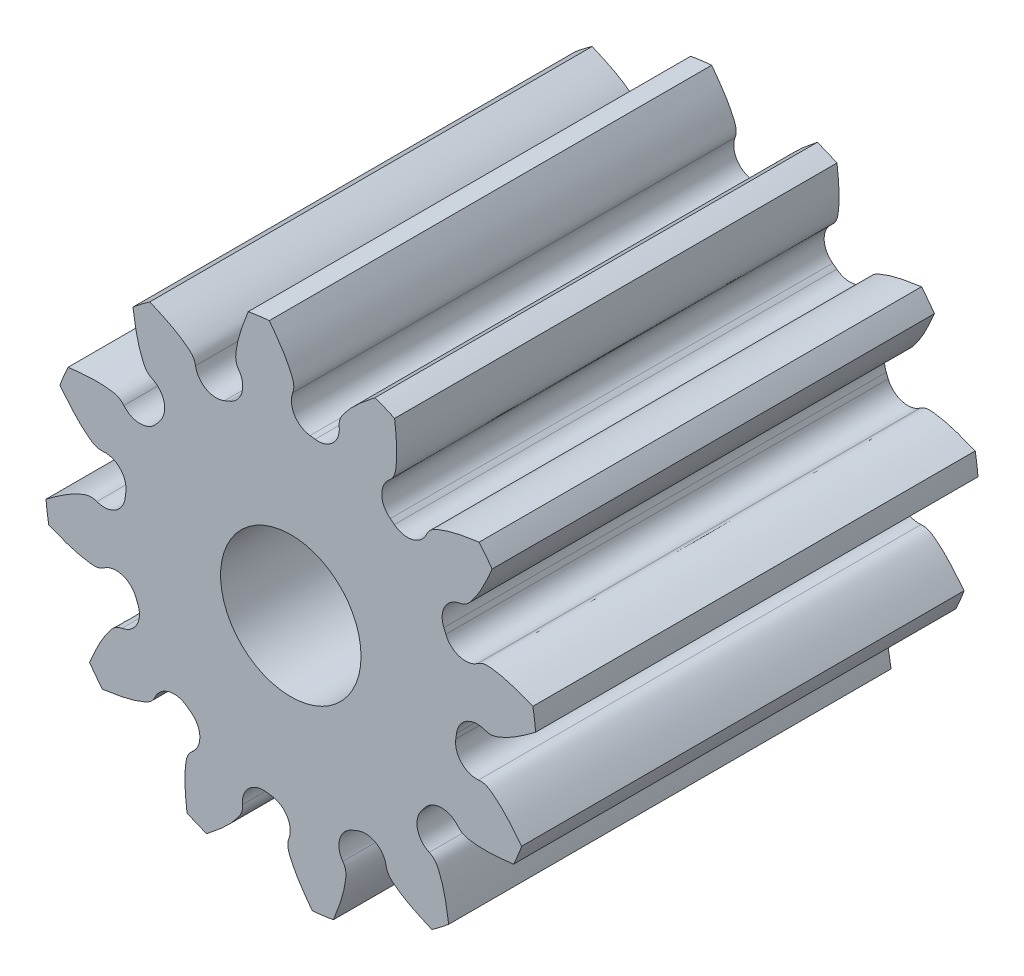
ISO-10303-21;
HEADER;
FILE_DESCRIPTION(('STEP AP214'),'2;1');
FILE_NAME('part.step','',(''),(''),'','','');
FILE_SCHEMA(('AUTOMOTIVE_DESIGN { 1 0 10303 214 1 1 1 1 }'));
ENDSEC;
DATA;
#1=APPLICATION_CONTEXT('core data for automotive mechanical design processes');
#2=APPLICATION_PROTOCOL_DEFINITION('international standard','automotive_design',2000,#1);
#3=PRODUCT_CONTEXT('',#1,'mechanical');
#4=PRODUCT('Part','Part','',(#3));
#5=PRODUCT_RELATED_PRODUCT_CATEGORY('part','',(#4));
#6=PRODUCT_DEFINITION_FORMATION('','',#4);
#7=PRODUCT_DEFINITION_CONTEXT('part definition',#1,'design');
#8=PRODUCT_DEFINITION('design','',#6,#7);
#9=PRODUCT_DEFINITION_SHAPE('','',#8);
#10=(LENGTH_UNIT() NAMED_UNIT(*) SI_UNIT(.MILLI.,.METRE.));
#11=(NAMED_UNIT(*) PLANE_ANGLE_UNIT() SI_UNIT($,.RADIAN.));
#12=(NAMED_UNIT(*) SI_UNIT($,.STERADIAN.) SOLID_ANGLE_UNIT());
#13=UNCERTAINTY_MEASURE_WITH_UNIT(LENGTH_MEASURE(1.E-05),#10,'distance_accuracy_value','');
#14=(GEOMETRIC_REPRESENTATION_CONTEXT(3) GLOBAL_UNCERTAINTY_ASSIGNED_CONTEXT((#13)) GLOBAL_UNIT_ASSIGNED_CONTEXT((#10,
#11,#12)) REPRESENTATION_CONTEXT('',''));
#15=CARTESIAN_POINT('',(0.,0.,0.));
#16=DIRECTION('',(0.,0.,1.));
#17=DIRECTION('',(1.,0.,0.));
#18=AXIS2_PLACEMENT_3D('',#15,#16,#17);
#19=CARTESIAN_POINT('',(0.,0.,6.3));
#20=DIRECTION('',(0.,0.,1.));
#21=DIRECTION('',(1.,0.,0.));
#22=AXIS2_PLACEMENT_3D('',#19,#20,#21);
#23=PLANE('',#22);
#24=CARTESIAN_POINT('',(2.24850627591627,-2.68220422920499,6.3));
#25=CARTESIAN_POINT('',(2.22088389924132,-2.49460282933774,6.3));
#26=CARTESIAN_POINT('',(2.18571989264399,-2.25578134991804,6.3));
#27=CARTESIAN_POINT('',(2.01364953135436,-1.87902305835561,6.3));
#28=CARTESIAN_POINT('',(1.72355811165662,-1.90253624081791,6.3));
#29=CARTESIAN_POINT('',(1.55748546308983,-1.83329039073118,6.3));
#30=CARTESIAN_POINT('',(1.52577211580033,-1.82006715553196,6.3));
#31=B_SPLINE_CURVE_WITH_KNOTS('',3,(#24,#25,#26,#27,#28,#29,#30),.UNSPECIFIED.,.F.,.F.,(4,1,1,1,
4),(0.,0.450553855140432,0.573566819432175,0.91856802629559,1.),.UNSPECIFIED.);
#32=CARTESIAN_POINT('',(2.24850627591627,-2.68220422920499,6.3));
#33=VERTEX_POINT('',#32);
#34=CARTESIAN_POINT('',(1.97109779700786,-1.93385719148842,6.3));
#35=VERTEX_POINT('',#34);
#36=EDGE_CURVE('E1393',#33,#35,#31,.T.);
#37=ORIENTED_EDGE('',*,*,#36,.T.);
#38=CARTESIAN_POINT('',(2.09655504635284,-1.66134943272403,6.3));
#39=DIRECTION('',(0.,0.,1.));
#40=DIRECTION('',(1.,0.,0.));
#41=AXIS2_PLACEMENT_3D('',#38,#39,#40);
#42=CIRCLE('',#41,0.3);
#43=CARTESIAN_POINT('',(1.86142737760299,-1.47502987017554,6.3));
#44=VERTEX_POINT('',#43);
#45=EDGE_CURVE('E983',#35,#44,#42,.F.);
#46=ORIENTED_EDGE('',*,*,#45,.T.);
#47=CARTESIAN_POINT('',(0.,0.,6.3));
#48=DIRECTION('',(0.,0.,1.));
#49=DIRECTION('',(1.,0.,0.));
#50=AXIS2_PLACEMENT_3D('',#47,#48,#49);
#51=CIRCLE('',#50,2.375);
#52=CARTESIAN_POINT('',(1.90635432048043,-1.41648798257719,6.3));
#53=VERTEX_POINT('',#52);
#54=EDGE_CURVE('E1466',#44,#53,#51,.T.);
#55=ORIENTED_EDGE('',*,*,#54,.T.);
#56=CARTESIAN_POINT('',(2.14715697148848,-1.59541278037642,6.3));
#57=DIRECTION('',(0.,0.,1.));
#58=DIRECTION('',(1.,0.,0.));
#59=AXIS2_PLACEMENT_3D('',#56,#57,#58);
#60=CIRCLE('',#59,0.3);
#61=CARTESIAN_POINT('',(2.37793397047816,-1.40373081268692,6.3));
#62=VERTEX_POINT('',#61);
#63=EDGE_CURVE('E11',#53,#62,#60,.F.);
#64=ORIENTED_EDGE('',*,*,#63,.T.);
#65=CARTESIAN_POINT('',(2.15281565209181,-1.00300038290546,6.3));
#66=CARTESIAN_POINT('',(2.17379272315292,-1.03021348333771,6.3));
#67=CARTESIAN_POINT('',(2.28364292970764,-1.17271977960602,6.3));
#68=CARTESIAN_POINT('',(2.3359741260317,-1.45901918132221,6.3));
#69=CARTESIAN_POINT('',(2.74442065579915,-1.52776837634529,6.3));
#70=CARTESIAN_POINT('',(2.98420929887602,-1.49995447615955,6.3));
#71=CARTESIAN_POINT('',(3.17257043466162,-1.47810582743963,6.3));
#72=B_SPLINE_CURVE_WITH_KNOTS('',3,(#65,#66,#67,#68,#69,#70,#71),.UNSPECIFIED.,.F.,.F.,(4,1,1,1,
4),(0.,0.0814319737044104,0.426433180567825,0.549446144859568,1.),.UNSPECIFIED.);
#73=CARTESIAN_POINT('',(3.17257043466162,-1.47810582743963,6.3));
#74=VERTEX_POINT('',#73);
#75=EDGE_CURVE('E481',#62,#74,#72,.T.);
#76=ORIENTED_EDGE('',*,*,#75,.T.);
#77=CARTESIAN_POINT('',(0.,0.,6.3));
#78=DIRECTION('',(0.,0.,1.));
#79=DIRECTION('',(0.866025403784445,-0.499999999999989,0.));
#80=AXIS2_PLACEMENT_3D('',#77,#78,#79);
#81=CIRCLE('',#80,3.5);
#82=CARTESIAN_POINT('',(3.28836567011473,-1.19860386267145,6.3));
#83=VERTEX_POINT('',#82);
#84=EDGE_CURVE('E486',#74,#83,#81,.T.);
#85=ORIENTED_EDGE('',*,*,#84,.T.);
#86=CARTESIAN_POINT('',(3.28836567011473,-1.19860386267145,6.3));
#87=CARTESIAN_POINT('',(3.17064329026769,-1.04994747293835,6.3));
#88=CARTESIAN_POINT('',(3.02077962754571,-0.860704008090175,6.3));
#89=CARTESIAN_POINT('',(2.68338317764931,-0.620456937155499,6.3));
#90=CARTESIAN_POINT('',(2.44391323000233,-0.78586566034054,6.3));
#91=CARTESIAN_POINT('',(2.26546717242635,-0.80893331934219,6.3));
#92=CARTESIAN_POINT('',(2.23139099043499,-0.813338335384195,6.3));
#93=B_SPLINE_CURVE_WITH_KNOTS('',3,(#86,#87,#88,#89,#90,#91,#92),.UNSPECIFIED.,.F.,.F.,(4,1,1,1,
4),(0.,0.450553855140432,0.573566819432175,0.91856802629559,1.),.UNSPECIFIED.);
#94=CARTESIAN_POINT('',(2.67394936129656,-0.689220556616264,6.3));
#95=VERTEX_POINT('',#94);
#96=EDGE_CURVE('E502',#83,#95,#93,.T.);
#97=ORIENTED_EDGE('',*,*,#96,.T.);
#98=CARTESIAN_POINT('',(2.64634464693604,-0.39049329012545,6.3));
#99=DIRECTION('',(0.,0.,1.));
#100=DIRECTION('',(1.,0.,0.));
#101=AXIS2_PLACEMENT_3D('',#98,#99,#100);
#102=CIRCLE('',#101,0.3);
#103=CARTESIAN_POINT('',(2.34955833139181,-0.346699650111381,6.3));
#104=VERTEX_POINT('',#103);
#105=EDGE_CURVE('E965',#95,#104,#102,.F.);
#106=ORIENTED_EDGE('',*,*,#105,.T.);
#107=CARTESIAN_POINT('',(2.35919526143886,-0.273537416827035,6.3));
#108=VERTEX_POINT('',#107);
#109=EDGE_CURVE('E1183',#104,#108,#51,.T.);
#110=ORIENTED_EDGE('',*,*,#109,.T.);
#111=CARTESIAN_POINT('',(2.65719887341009,-0.308089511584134,6.3));
#112=DIRECTION('',(0.,0.,1.));
#113=DIRECTION('',(1.,0.,0.));
#114=AXIS2_PLACEMENT_3D('',#111,#112,#113);
#115=CIRCLE('',#114,0.3);
#116=CARTESIAN_POINT('',(2.76121663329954,-0.0266995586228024,6.3));
#117=VERTEX_POINT('',#116);
#118=EDGE_CURVE('E1159',#108,#117,#115,.F.);
#119=ORIENTED_EDGE('',*,*,#118,.T.);
#120=CARTESIAN_POINT('',(2.36589323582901,0.207784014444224,6.3));
#121=CARTESIAN_POINT('',(2.39766646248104,0.194705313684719,6.3));
#122=CARTESIAN_POINT('',(2.56405268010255,0.126216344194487,6.3));
#123=CARTESIAN_POINT('',(2.75252252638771,-0.0955606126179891,6.3));
#124=CARTESIAN_POINT('',(3.14062219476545,0.0491241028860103,6.3));
#125=CARTESIAN_POINT('',(3.33437830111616,0.193105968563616,6.3));
#126=CARTESIAN_POINT('',(3.48657950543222,0.306208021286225,6.3));
#127=B_SPLINE_CURVE_WITH_KNOTS('',3,(#120,#121,#122,#123,#124,#125,#126),.UNSPECIFIED.,.F.,.F.,
(4,1,1,1,4),(0.,0.0814319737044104,0.426433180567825,0.549446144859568,1.),.UNSPECIFIED.);
#128=CARTESIAN_POINT('',(3.48657950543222,0.306208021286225,6.3));
#129=VERTEX_POINT('',#128);
#130=EDGE_CURVE('E834',#117,#129,#127,.T.);
#131=ORIENTED_EDGE('',*,*,#130,.T.);
#132=CARTESIAN_POINT('',(0.,0.,6.3));
#133=DIRECTION('',(0.,0.,1.));
#134=DIRECTION('',(1.,0.,0.));
#135=AXIS2_PLACEMENT_3D('',#132,#133,#134);
#136=CIRCLE('',#135,3.5);
#137=CARTESIAN_POINT('',(3.44711013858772,0.606161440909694,6.3));
#138=VERTEX_POINT('',#137);
#139=EDGE_CURVE('E839',#129,#138,#136,.T.);
#140=ORIENTED_EDGE('',*,*,#139,.T.);
#141=CARTESIAN_POINT('',(3.44711013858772,0.606161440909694,6.3));
#142=CARTESIAN_POINT('',(3.27083137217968,0.676040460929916,6.3));
#143=CARTESIAN_POINT('',(3.04642390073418,0.76499827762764,6.3));
#144=CARTESIAN_POINT('',(2.63410646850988,0.804360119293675,6.3));
#145=CARTESIAN_POINT('',(2.50942377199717,0.54137698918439,6.3));
#146=CARTESIAN_POINT('',(2.36641878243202,0.43217678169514,6.3));
#147=CARTESIAN_POINT('',(2.33911045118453,0.411323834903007,6.3));
#148=B_SPLINE_CURVE_WITH_KNOTS('',3,(#141,#142,#143,#144,#145,#146,#147),.UNSPECIFIED.,.F.,.F.,
(4,1,1,1,4),(0.,0.450553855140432,0.573566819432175,0.91856802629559,1.),.UNSPECIFIED.);
#149=CARTESIAN_POINT('',(2.66031835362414,0.740092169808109,6.3));
#150=VERTEX_POINT('',#149);
#151=EDGE_CURVE('E1195',#138,#150,#148,.T.);
#152=ORIENTED_EDGE('',*,*,#151,.T.);
#153=CARTESIAN_POINT('',(2.4870483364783,0.984995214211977,6.3));
#154=DIRECTION('',(0.,0.,1.));
#155=DIRECTION('',(1.,0.,0.));
#156=AXIS2_PLACEMENT_3D('',#153,#154,#155);
#157=CIRCLE('',#156,0.3);
#158=CARTESIAN_POINT('',(2.20812702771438,0.874528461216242,6.3));
#159=VERTEX_POINT('',#158);
#160=EDGE_CURVE('E1164',#150,#159,#157,.F.);
#161=ORIENTED_EDGE('',*,*,#160,.T.);
#162=CARTESIAN_POINT('',(2.17989173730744,0.94270727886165,6.3));
#163=VERTEX_POINT('',#162);
#164=EDGE_CURVE('E1179',#159,#163,#51,.T.);
#165=ORIENTED_EDGE('',*,*,#164,.T.);
#166=CARTESIAN_POINT('',(2.4552464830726,1.06178609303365,6.3));
#167=DIRECTION('',(0.,0.,1.));
#168=DIRECTION('',(1.,0.,0.));
#169=AXIS2_PLACEMENT_3D('',#166,#167,#168);
#170=CIRCLE('',#169,0.3);
#171=CARTESIAN_POINT('',(2.40463352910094,1.3574858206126,6.3));
#172=VERTEX_POINT('',#171);
#173=EDGE_CURVE('E1141',#163,#172,#170,.F.);
#174=ORIENTED_EDGE('',*,*,#173,.T.);
#175=CARTESIAN_POINT('',(1.94503163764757,1.36289285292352,6.3));
#176=CARTESIAN_POINT('',(1.97908740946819,1.36745297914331,6.3));
#177=CARTESIAN_POINT('',(2.15742658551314,1.3913329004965,6.3));
#178=CARTESIAN_POINT('',(2.43153473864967,1.29350334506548,6.3));
#179=CARTESIAN_POINT('',(2.69529655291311,1.61285381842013,6.3));
#180=CARTESIAN_POINT('',(2.79110333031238,1.83442382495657,6.3));
#181=CARTESIAN_POINT('',(2.86636241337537,2.00847367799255,6.3));
#182=B_SPLINE_CURVE_WITH_KNOTS('',3,(#175,#176,#177,#178,#179,#180,#181),.UNSPECIFIED.,.F.,.F.,
(4,1,1,1,4),(0.,0.0814319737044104,0.426433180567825,0.549446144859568,1.),.UNSPECIFIED.);
#183=CARTESIAN_POINT('',(2.86636241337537,2.00847367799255,6.3));
#184=VERTEX_POINT('',#183);
#185=EDGE_CURVE('E824',#172,#184,#182,.T.);
#186=ORIENTED_EDGE('',*,*,#185,.T.);
#187=CARTESIAN_POINT('',(0.,0.,6.3));
#188=DIRECTION('',(0.,0.,1.));
#189=DIRECTION('',(0.866025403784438,0.500000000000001,0.));
#190=AXIS2_PLACEMENT_3D('',#187,#188,#189);
#191=CIRCLE('',#190,3.5);
#192=CARTESIAN_POINT('',(2.68220422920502,2.24850627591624,6.3));
#193=VERTEX_POINT('',#192);
#194=EDGE_CURVE('E804',#184,#193,#191,.T.);
#195=ORIENTED_EDGE('',*,*,#194,.T.);
#196=CARTESIAN_POINT('',(2.68220422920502,2.24850627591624,6.3));
#197=CARTESIAN_POINT('',(2.49460282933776,2.22088389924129,6.3));
#198=CARTESIAN_POINT('',(2.25578134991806,2.18571989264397,6.3));
#199=CARTESIAN_POINT('',(1.87902305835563,2.01364953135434,6.3));
#200=CARTESIAN_POINT('',(1.90253624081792,1.7235581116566,6.3));
#201=CARTESIAN_POINT('',(1.8332903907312,1.55748546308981,6.3));
#202=CARTESIAN_POINT('',(1.82006715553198,1.52577211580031,6.3));
#203=B_SPLINE_CURVE_WITH_KNOTS('',3,(#196,#197,#198,#199,#200,#201,#202),.UNSPECIFIED.,.F.,.F.,
(4,1,1,1,4),(0.,0.450553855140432,0.573566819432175,0.91856802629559,1.),.UNSPECIFIED.);
#204=CARTESIAN_POINT('',(1.93385719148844,1.97109779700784,6.3));
#205=VERTEX_POINT('',#204);
#206=EDGE_CURVE('E796',#193,#205,#203,.T.);
#207=ORIENTED_EDGE('',*,*,#206,.T.);
#208=CARTESIAN_POINT('',(1.66134943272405,2.09655504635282,6.3));
#209=DIRECTION('',(0.,0.,1.));
#210=DIRECTION('',(1.,0.,0.));
#211=AXIS2_PLACEMENT_3D('',#208,#209,#210);
#212=CIRCLE('',#211,0.3);
#213=CARTESIAN_POINT('',(1.47502987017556,1.86142737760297,6.3));
#214=VERTEX_POINT('',#213);
#215=EDGE_CURVE('E1145',#205,#214,#212,.F.);
#216=ORIENTED_EDGE('',*,*,#215,.T.);
#217=CARTESIAN_POINT('',(1.41648798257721,1.90635432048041,6.3));
#218=VERTEX_POINT('',#217);
#219=EDGE_CURVE('E1188',#214,#218,#51,.T.);
#220=ORIENTED_EDGE('',*,*,#219,.T.);
#221=CARTESIAN_POINT('',(1.59541278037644,2.14715697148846,6.3));
#222=DIRECTION('',(0.,0.,1.));
#223=DIRECTION('',(1.,0.,0.));
#224=AXIS2_PLACEMENT_3D('',#221,#222,#223);
#225=CIRCLE('',#224,0.3);
#226=CARTESIAN_POINT('',(1.40373081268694,2.37793397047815,6.3));
#227=VERTEX_POINT('',#226);
#228=EDGE_CURVE('E1123',#218,#227,#225,.F.);
#229=ORIENTED_EDGE('',*,*,#228,.T.);
#230=CARTESIAN_POINT('',(1.00300038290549,2.1528156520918,6.3));
#231=CARTESIAN_POINT('',(1.03021348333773,2.17379272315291,6.3));
#232=CARTESIAN_POINT('',(1.17271977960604,2.28364292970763,6.3));
#233=CARTESIAN_POINT('',(1.45901918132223,2.33597412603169,6.3));
#234=CARTESIAN_POINT('',(1.52776837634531,2.74442065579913,6.3));
#235=CARTESIAN_POINT('',(1.49995447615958,2.984209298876,6.3));
#236=CARTESIAN_POINT('',(1.47810582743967,3.1725704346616,6.3));
#237=B_SPLINE_CURVE_WITH_KNOTS('',3,(#230,#231,#232,#233,#234,#235,#236),.UNSPECIFIED.,.F.,.F.,
(4,1,1,1,4),(0.,0.0814319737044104,0.426433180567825,0.549446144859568,1.),.UNSPECIFIED.);
#238=CARTESIAN_POINT('',(1.47810582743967,3.1725704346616,6.3));
#239=VERTEX_POINT('',#238);
#240=EDGE_CURVE('E770',#227,#239,#237,.T.);
#241=ORIENTED_EDGE('',*,*,#240,.T.);
#242=CARTESIAN_POINT('',(0.,0.,6.3));
#243=DIRECTION('',(0.,0.,1.));
#244=DIRECTION('',(0.499999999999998,0.86602540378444,0.));
#245=AXIS2_PLACEMENT_3D('',#242,#243,#244);
#246=CIRCLE('',#245,3.5);
#247=CARTESIAN_POINT('',(1.19860386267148,3.28836567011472,6.3));
#248=VERTEX_POINT('',#247);
#249=EDGE_CURVE('E775',#239,#248,#246,.T.);
#250=ORIENTED_EDGE('',*,*,#249,.T.);
#251=CARTESIAN_POINT('',(1.19860386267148,3.28836567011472,6.3));
#252=CARTESIAN_POINT('',(1.04994747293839,3.17064329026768,6.3));
#253=CARTESIAN_POINT('',(0.860704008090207,3.02077962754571,6.3));
#254=CARTESIAN_POINT('',(0.620456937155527,2.68338317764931,6.3));
#255=CARTESIAN_POINT('',(0.785865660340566,2.44391323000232,6.3));
#256=CARTESIAN_POINT('',(0.808933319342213,2.26546717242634,6.3));
#257=CARTESIAN_POINT('',(0.813338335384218,2.23139099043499,6.3));
#258=B_SPLINE_CURVE_WITH_KNOTS('',3,(#251,#252,#253,#254,#255,#256,#257),.UNSPECIFIED.,.F.,.F.,
(4,1,1,1,4),(0.,0.450553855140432,0.573566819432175,0.91856802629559,1.),.UNSPECIFIED.);
#259=CARTESIAN_POINT('',(0.689220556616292,2.67394936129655,6.3));
#260=VERTEX_POINT('',#259);
#261=EDGE_CURVE('E1233',#248,#260,#258,.T.);
#262=ORIENTED_EDGE('',*,*,#261,.T.);
#263=CARTESIAN_POINT('',(0.390493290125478,2.64634464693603,6.3));
#264=DIRECTION('',(0.,0.,1.));
#265=DIRECTION('',(1.,0.,0.));
#266=AXIS2_PLACEMENT_3D('',#263,#264,#265);
#267=CIRCLE('',#266,0.3);
#268=CARTESIAN_POINT('',(0.346699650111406,2.3495583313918,6.3));
#269=VERTEX_POINT('',#268);
#270=EDGE_CURVE('E1127',#260,#269,#267,.F.);
#271=ORIENTED_EDGE('',*,*,#270,.T.);
#272=CARTESIAN_POINT('',(0.273537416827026,2.35919526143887,6.3));
#273=VERTEX_POINT('',#272);
#274=EDGE_CURVE('E1493',#269,#273,#51,.T.);
#275=ORIENTED_EDGE('',*,*,#274,.T.);
#276=CARTESIAN_POINT('',(0.308089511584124,2.65719887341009,6.3));
#277=DIRECTION('',(0.,0.,1.));
#278=DIRECTION('',(1.,0.,0.));
#279=AXIS2_PLACEMENT_3D('',#276,#277,#278);
#280=CIRCLE('',#279,0.3);
#281=CARTESIAN_POINT('',(0.026699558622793,2.76121663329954,6.3));
#282=VERTEX_POINT('',#281);
#283=EDGE_CURVE('E1105',#273,#282,#280,.F.);
#284=ORIENTED_EDGE('',*,*,#283,.T.);
#285=CARTESIAN_POINT('',(-0.207784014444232,2.365893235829,6.3));
#286=CARTESIAN_POINT('',(-0.194705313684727,2.39766646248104,6.3));
#287=CARTESIAN_POINT('',(-0.126216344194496,2.56405268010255,6.3));
#288=CARTESIAN_POINT('',(0.0955606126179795,2.75252252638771,6.3));
#289=CARTESIAN_POINT('',(-0.0491241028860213,3.14062219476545,6.3));
#290=CARTESIAN_POINT('',(-0.193105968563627,3.33437830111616,6.3));
#291=CARTESIAN_POINT('',(-0.306208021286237,3.48657950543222,6.3));
#292=B_SPLINE_CURVE_WITH_KNOTS('',3,(#285,#286,#287,#288,#289,#290,#291),.UNSPECIFIED.,.F.,.F.,
(4,1,1,1,4),(0.,0.0814319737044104,0.426433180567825,0.549446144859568,1.),.UNSPECIFIED.);
#293=CARTESIAN_POINT('',(-0.306208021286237,3.48657950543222,6.3));
#294=VERTEX_POINT('',#293);
#295=EDGE_CURVE('E760',#282,#294,#292,.T.);
#296=ORIENTED_EDGE('',*,*,#295,.T.);
#297=CARTESIAN_POINT('',(0.,0.,6.3));
#298=DIRECTION('',(0.,0.,1.));
#299=DIRECTION('',(0.,1.,0.));
#300=AXIS2_PLACEMENT_3D('',#297,#298,#299);
#301=CIRCLE('',#300,3.5);
#302=CARTESIAN_POINT('',(-0.606161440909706,3.44711013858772,6.3));
#303=VERTEX_POINT('',#302);
#304=EDGE_CURVE('E740',#294,#303,#301,.T.);
#305=ORIENTED_EDGE('',*,*,#304,.T.);
#306=CARTESIAN_POINT('',(-0.606161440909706,3.44711013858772,6.3));
#307=CARTESIAN_POINT('',(-0.676040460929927,3.27083137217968,6.3));
#308=CARTESIAN_POINT('',(-0.764998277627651,3.04642390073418,6.3));
#309=CARTESIAN_POINT('',(-0.804360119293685,2.63410646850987,6.3));
#310=CARTESIAN_POINT('',(-0.541376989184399,2.50942377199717,6.3));
#311=CARTESIAN_POINT('',(-0.432176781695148,2.36641878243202,6.3));
#312=CARTESIAN_POINT('',(-0.411323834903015,2.33911045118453,6.3));
#313=B_SPLINE_CURVE_WITH_KNOTS('',3,(#306,#307,#308,#309,#310,#311,#312),.UNSPECIFIED.,.F.,.F.,
(4,1,1,1,4),(0.,0.450553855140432,0.573566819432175,0.91856802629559,1.),.UNSPECIFIED.);
#314=CARTESIAN_POINT('',(-0.740092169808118,2.66031835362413,6.3));
#315=VERTEX_POINT('',#314);
#316=EDGE_CURVE('E732',#303,#315,#313,.T.);
#317=ORIENTED_EDGE('',*,*,#316,.T.);
#318=CARTESIAN_POINT('',(-0.984995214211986,2.4870483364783,6.3));
#319=DIRECTION('',(0.,0.,1.));
#320=DIRECTION('',(1.,0.,0.));
#321=AXIS2_PLACEMENT_3D('',#318,#319,#320);
#322=CIRCLE('',#321,0.3);
#323=CARTESIAN_POINT('',(-0.87452846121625,2.20812702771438,6.3));
#324=VERTEX_POINT('',#323);
#325=EDGE_CURVE('E1109',#315,#324,#322,.F.);
#326=ORIENTED_EDGE('',*,*,#325,.T.);
#327=CARTESIAN_POINT('',(-0.942707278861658,2.17989173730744,6.3));
#328=VERTEX_POINT('',#327);
#329=EDGE_CURVE('E1489',#324,#328,#51,.T.);
#330=ORIENTED_EDGE('',*,*,#329,.T.);
#331=CARTESIAN_POINT('',(-1.06178609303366,2.45524648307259,6.3));
#332=DIRECTION('',(0.,0.,1.));
#333=DIRECTION('',(1.,0.,0.));
#334=AXIS2_PLACEMENT_3D('',#331,#332,#333);
#335=CIRCLE('',#334,0.3);
#336=CARTESIAN_POINT('',(-1.3574858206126,2.40463352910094,6.3));
#337=VERTEX_POINT('',#336);
#338=EDGE_CURVE('E1087',#328,#337,#335,.F.);
#339=ORIENTED_EDGE('',*,*,#338,.T.);
#340=CARTESIAN_POINT('',(-1.36289285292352,1.94503163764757,6.3));
#341=CARTESIAN_POINT('',(-1.36745297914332,1.97908740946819,6.3));
#342=CARTESIAN_POINT('',(-1.39133290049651,2.15742658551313,6.3));
#343=CARTESIAN_POINT('',(-1.29350334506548,2.43153473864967,6.3));
#344=CARTESIAN_POINT('',(-1.61285381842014,2.69529655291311,6.3));
#345=CARTESIAN_POINT('',(-1.83442382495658,2.79110333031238,6.3));
#346=CARTESIAN_POINT('',(-2.00847367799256,2.86636241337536,6.3));
#347=B_SPLINE_CURVE_WITH_KNOTS('',3,(#340,#341,#342,#343,#344,#345,#346),.UNSPECIFIED.,.F.,.F.,
(4,1,1,1,4),(0.,0.0814319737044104,0.426433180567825,0.549446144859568,1.),.UNSPECIFIED.);
#348=CARTESIAN_POINT('',(-2.00847367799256,2.86636241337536,6.3));
#349=VERTEX_POINT('',#348);
#350=EDGE_CURVE('E706',#337,#349,#347,.T.);
#351=ORIENTED_EDGE('',*,*,#350,.T.);
#352=CARTESIAN_POINT('',(0.,0.,6.3));
#353=DIRECTION('',(0.,0.,1.));
#354=DIRECTION('',(-0.500000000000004,0.866025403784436,0.));
#355=AXIS2_PLACEMENT_3D('',#352,#353,#354);
#356=CIRCLE('',#355,3.5);
#357=CARTESIAN_POINT('',(-2.24850627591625,2.68220422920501,6.3));
#358=VERTEX_POINT('',#357);
#359=EDGE_CURVE('E711',#349,#358,#356,.T.);
#360=ORIENTED_EDGE('',*,*,#359,.T.);
#361=CARTESIAN_POINT('',(-2.24850627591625,2.68220422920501,6.3));
#362=CARTESIAN_POINT('',(-2.2208838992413,2.49460282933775,6.3));
#363=CARTESIAN_POINT('',(-2.18571989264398,2.25578134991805,6.3));
#364=CARTESIAN_POINT('',(-2.01364953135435,1.87902305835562,6.3));
#365=CARTESIAN_POINT('',(-1.72355811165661,1.90253624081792,6.3));
#366=CARTESIAN_POINT('',(-1.55748546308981,1.8332903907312,6.3));
#367=CARTESIAN_POINT('',(-1.52577211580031,1.82006715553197,6.3));
#368=B_SPLINE_CURVE_WITH_KNOTS('',3,(#361,#362,#363,#364,#365,#366,#367),.UNSPECIFIED.,.F.,.F.,
(4,1,1,1,4),(0.,0.450553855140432,0.573566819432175,0.91856802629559,1.),.UNSPECIFIED.);
#369=CARTESIAN_POINT('',(-1.97109779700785,1.93385719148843,6.3));
#370=VERTEX_POINT('',#369);
#371=EDGE_CURVE('E1273',#358,#370,#368,.T.);
#372=ORIENTED_EDGE('',*,*,#371,.T.);
#373=CARTESIAN_POINT('',(-2.09655504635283,1.66134943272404,6.3));
#374=DIRECTION('',(0.,0.,1.));
#375=DIRECTION('',(1.,0.,0.));
#376=AXIS2_PLACEMENT_3D('',#373,#374,#375);
#377=CIRCLE('',#376,0.3);
#378=CARTESIAN_POINT('',(-1.86142737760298,1.47502987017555,6.3));
#379=VERTEX_POINT('',#378);
#380=EDGE_CURVE('E1091',#370,#379,#377,.F.);
#381=ORIENTED_EDGE('',*,*,#380,.T.);
#382=CARTESIAN_POINT('',(-1.90635432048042,1.41648798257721,6.3));
#383=VERTEX_POINT('',#382);
#384=EDGE_CURVE('E1485',#379,#383,#51,.T.);
#385=ORIENTED_EDGE('',*,*,#384,.T.);
#386=CARTESIAN_POINT('',(-2.14715697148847,1.59541278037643,6.3));
#387=DIRECTION('',(0.,0.,1.));
#388=DIRECTION('',(1.,0.,0.));
#389=AXIS2_PLACEMENT_3D('',#386,#387,#388);
#390=CIRCLE('',#389,0.3);
#391=CARTESIAN_POINT('',(-2.37793397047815,1.40373081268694,6.3));
#392=VERTEX_POINT('',#391);
#393=EDGE_CURVE('E1069',#383,#392,#390,.F.);
#394=ORIENTED_EDGE('',*,*,#393,.T.);
#395=CARTESIAN_POINT('',(-2.1528156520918,1.00300038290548,6.3));
#396=CARTESIAN_POINT('',(-2.17379272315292,1.03021348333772,6.3));
#397=CARTESIAN_POINT('',(-2.28364292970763,1.17271977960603,6.3));
#398=CARTESIAN_POINT('',(-2.33597412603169,1.45901918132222,6.3));
#399=CARTESIAN_POINT('',(-2.74442065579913,1.5277683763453,6.3));
#400=CARTESIAN_POINT('',(-2.98420929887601,1.49995447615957,6.3));
#401=CARTESIAN_POINT('',(-3.17257043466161,1.47810582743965,6.3));
#402=B_SPLINE_CURVE_WITH_KNOTS('',3,(#395,#396,#397,#398,#399,#400,#401),.UNSPECIFIED.,.F.,.F.,
(4,1,1,1,4),(0.,0.0814319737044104,0.426433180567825,0.549446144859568,1.),.UNSPECIFIED.);
#403=CARTESIAN_POINT('',(-3.17257043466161,1.47810582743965,6.3));
#404=VERTEX_POINT('',#403);
#405=EDGE_CURVE('E696',#392,#404,#402,.T.);
#406=ORIENTED_EDGE('',*,*,#405,.T.);
#407=CARTESIAN_POINT('',(0.,0.,6.3));
#408=DIRECTION('',(0.,0.,1.));
#409=DIRECTION('',(-0.866025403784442,0.499999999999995,0.));
#410=AXIS2_PLACEMENT_3D('',#407,#408,#409);
#411=CIRCLE('',#410,3.5);
#412=CARTESIAN_POINT('',(-3.28836567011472,1.19860386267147,6.3));
#413=VERTEX_POINT('',#412);
#414=EDGE_CURVE('E676',#404,#413,#411,.T.);
#415=ORIENTED_EDGE('',*,*,#414,.T.);
#416=CARTESIAN_POINT('',(-3.28836567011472,1.19860386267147,6.3));
#417=CARTESIAN_POINT('',(-3.17064329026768,1.04994747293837,6.3));
#418=CARTESIAN_POINT('',(-3.02077962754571,0.860704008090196,6.3));
#419=CARTESIAN_POINT('',(-2.68338317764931,0.620456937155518,6.3));
#420=CARTESIAN_POINT('',(-2.44391323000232,0.785865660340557,6.3));
#421=CARTESIAN_POINT('',(-2.26546717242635,0.808933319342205,6.3));
#422=CARTESIAN_POINT('',(-2.23139099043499,0.81333833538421,6.3));
#423=B_SPLINE_CURVE_WITH_KNOTS('',3,(#416,#417,#418,#419,#420,#421,#422),.UNSPECIFIED.,.F.,.F.,
(4,1,1,1,4),(0.,0.450553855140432,0.573566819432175,0.91856802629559,1.),.UNSPECIFIED.);
#424=CARTESIAN_POINT('',(-2.67394936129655,0.689220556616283,6.3));
#425=VERTEX_POINT('',#424);
#426=EDGE_CURVE('E668',#413,#425,#423,.T.);
#427=ORIENTED_EDGE('',*,*,#426,.T.);
#428=CARTESIAN_POINT('',(-2.64634464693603,0.390493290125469,6.3));
#429=DIRECTION('',(0.,0.,1.));
#430=DIRECTION('',(1.,0.,0.));
#431=AXIS2_PLACEMENT_3D('',#428,#429,#430);
#432=CIRCLE('',#431,0.3);
#433=CARTESIAN_POINT('',(-2.3495583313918,0.346699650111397,6.3));
#434=VERTEX_POINT('',#433);
#435=EDGE_CURVE('E1073',#425,#434,#432,.F.);
#436=ORIENTED_EDGE('',*,*,#435,.T.);
#437=CARTESIAN_POINT('',(-2.35919526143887,0.273537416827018,6.3));
#438=VERTEX_POINT('',#437);
#439=EDGE_CURVE('E1481',#434,#438,#51,.T.);
#440=ORIENTED_EDGE('',*,*,#439,.T.);
#441=CARTESIAN_POINT('',(-2.65719887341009,0.308089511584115,6.3));
#442=DIRECTION('',(0.,0.,1.));
#443=DIRECTION('',(1.,0.,0.));
#444=AXIS2_PLACEMENT_3D('',#441,#442,#443);
#445=CIRCLE('',#444,0.3);
#446=CARTESIAN_POINT('',(-2.76121663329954,0.0266995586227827,6.3));
#447=VERTEX_POINT('',#446);
#448=EDGE_CURVE('E1051',#438,#447,#445,.F.);
#449=ORIENTED_EDGE('',*,*,#448,.T.);
#450=CARTESIAN_POINT('',(-2.365893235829,-0.20778401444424,6.3));
#451=CARTESIAN_POINT('',(-2.39766646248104,-0.194705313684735,6.3));
#452=CARTESIAN_POINT('',(-2.56405268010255,-0.126216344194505,6.3));
#453=CARTESIAN_POINT('',(-2.75252252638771,0.0955606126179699,6.3));
#454=CARTESIAN_POINT('',(-3.14062219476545,-0.0491241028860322,6.3));
#455=CARTESIAN_POINT('',(-3.33437830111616,-0.193105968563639,6.3));
#456=CARTESIAN_POINT('',(-3.48657950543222,-0.306208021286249,6.3));
#457=B_SPLINE_CURVE_WITH_KNOTS('',3,(#450,#451,#452,#453,#454,#455,#456),.UNSPECIFIED.,.F.,.F.,
(4,1,1,1,4),(0.,0.0814319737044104,0.426433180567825,0.549446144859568,1.),.UNSPECIFIED.);
#458=CARTESIAN_POINT('',(-3.48657950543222,-0.306208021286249,6.3));
#459=VERTEX_POINT('',#458);
#460=EDGE_CURVE('E642',#447,#459,#457,.T.);
#461=ORIENTED_EDGE('',*,*,#460,.T.);
#462=CARTESIAN_POINT('',(0.,0.,6.3));
#463=DIRECTION('',(0.,0.,1.));
#464=DIRECTION('',(-1.,0.,0.));
#465=AXIS2_PLACEMENT_3D('',#462,#463,#464);
#466=CIRCLE('',#465,3.5);
#467=CARTESIAN_POINT('',(-3.44711013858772,-0.606161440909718,6.3));
#468=VERTEX_POINT('',#467);
#469=EDGE_CURVE('E647',#459,#468,#466,.T.);
#470=ORIENTED_EDGE('',*,*,#469,.T.);
#471=CARTESIAN_POINT('',(-3.44711013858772,-0.606161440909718,6.3));
#472=CARTESIAN_POINT('',(-3.27083137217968,-0.676040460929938,6.3));
#473=CARTESIAN_POINT('',(-3.04642390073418,-0.764998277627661,6.3));
#474=CARTESIAN_POINT('',(-2.63410646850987,-0.804360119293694,6.3));
#475=CARTESIAN_POINT('',(-2.50942377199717,-0.541376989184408,6.3));
#476=CARTESIAN_POINT('',(-2.36641878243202,-0.432176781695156,6.3));
#477=CARTESIAN_POINT('',(-2.33911045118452,-0.411323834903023,6.3));
#478=B_SPLINE_CURVE_WITH_KNOTS('',3,(#471,#472,#473,#474,#475,#476,#477),.UNSPECIFIED.,.F.,.F.,
(4,1,1,1,4),(0.,0.450553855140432,0.573566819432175,0.91856802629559,1.),.UNSPECIFIED.);
#479=CARTESIAN_POINT('',(-2.66031835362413,-0.740092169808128,6.3));
#480=VERTEX_POINT('',#479);
#481=EDGE_CURVE('E1313',#468,#480,#478,.T.);
#482=ORIENTED_EDGE('',*,*,#481,.T.);
#483=CARTESIAN_POINT('',(-2.4870483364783,-0.984995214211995,6.3));
#484=DIRECTION('',(0.,0.,1.));
#485=DIRECTION('',(1.,0.,0.));
#486=AXIS2_PLACEMENT_3D('',#483,#484,#485);
#487=CIRCLE('',#486,0.3);
#488=CARTESIAN_POINT('',(-2.20812702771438,-0.874528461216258,6.3));
#489=VERTEX_POINT('',#488);
#490=EDGE_CURVE('E1055',#480,#489,#487,.F.);
#491=ORIENTED_EDGE('',*,*,#490,.T.);
#492=CARTESIAN_POINT('',(-2.17989173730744,-0.942707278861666,6.3));
#493=VERTEX_POINT('',#492);
#494=EDGE_CURVE('E1477',#489,#493,#51,.T.);
#495=ORIENTED_EDGE('',*,*,#494,.T.);
#496=CARTESIAN_POINT('',(-2.45524648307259,-1.06178609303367,6.3));
#497=DIRECTION('',(0.,0.,1.));
#498=DIRECTION('',(1.,0.,0.));
#499=AXIS2_PLACEMENT_3D('',#496,#497,#498);
#500=CIRCLE('',#499,0.3);
#501=CARTESIAN_POINT('',(-2.40463352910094,-1.35748582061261,6.3));
#502=VERTEX_POINT('',#501);
#503=EDGE_CURVE('E1033',#493,#502,#500,.F.);
#504=ORIENTED_EDGE('',*,*,#503,.T.);
#505=CARTESIAN_POINT('',(-1.94503163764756,-1.36289285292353,6.3));
#506=CARTESIAN_POINT('',(-1.97908740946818,-1.36745297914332,6.3));
#507=CARTESIAN_POINT('',(-2.15742658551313,-1.39133290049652,6.3));
#508=CARTESIAN_POINT('',(-2.43153473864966,-1.29350334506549,6.3));
#509=CARTESIAN_POINT('',(-2.6952965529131,-1.61285381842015,6.3));
#510=CARTESIAN_POINT('',(-2.79110333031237,-1.83442382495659,6.3));
#511=CARTESIAN_POINT('',(-2.86636241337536,-2.00847367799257,6.3));
#512=B_SPLINE_CURVE_WITH_KNOTS('',3,(#505,#506,#507,#508,#509,#510,#511),.UNSPECIFIED.,.F.,.F.,
(4,1,1,1,4),(0.,0.0814319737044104,0.426433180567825,0.549446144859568,1.),.UNSPECIFIED.);
#513=CARTESIAN_POINT('',(-2.86636241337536,-2.00847367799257,6.3));
#514=VERTEX_POINT('',#513);
#515=EDGE_CURVE('E632',#502,#514,#512,.T.);
#516=ORIENTED_EDGE('',*,*,#515,.T.);
#517=CARTESIAN_POINT('',(0.,0.,6.3));
#518=DIRECTION('',(0.,0.,1.));
#519=DIRECTION('',(-0.866025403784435,-0.500000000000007,0.));
#520=AXIS2_PLACEMENT_3D('',#517,#518,#519);
#521=CIRCLE('',#520,3.5);
#522=CARTESIAN_POINT('',(-2.682204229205,-2.24850627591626,6.3));
#523=VERTEX_POINT('',#522);
#524=EDGE_CURVE('E612',#514,#523,#521,.T.);
#525=ORIENTED_EDGE('',*,*,#524,.T.);
#526=CARTESIAN_POINT('',(-2.682204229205,-2.24850627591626,6.3));
#527=CARTESIAN_POINT('',(-2.49460282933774,-2.22088389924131,6.3));
#528=CARTESIAN_POINT('',(-2.25578134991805,-2.18571989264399,6.3));
#529=CARTESIAN_POINT('',(-1.87902305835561,-2.01364953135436,6.3));
#530=CARTESIAN_POINT('',(-1.90253624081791,-1.72355811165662,6.3));
#531=CARTESIAN_POINT('',(-1.83329039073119,-1.55748546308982,6.3));
#532=CARTESIAN_POINT('',(-1.82006715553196,-1.52577211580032,6.3));
#533=B_SPLINE_CURVE_WITH_KNOTS('',3,(#526,#527,#528,#529,#530,#531,#532),.UNSPECIFIED.,.F.,.F.,
(4,1,1,1,4),(0.,0.450553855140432,0.573566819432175,0.91856802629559,1.),.UNSPECIFIED.);
#534=CARTESIAN_POINT('',(-1.93385719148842,-1.97109779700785,6.3));
#535=VERTEX_POINT('',#534);
#536=EDGE_CURVE('E604',#523,#535,#533,.T.);
#537=ORIENTED_EDGE('',*,*,#536,.T.);
#538=CARTESIAN_POINT('',(-1.66134943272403,-2.09655504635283,6.3));
#539=DIRECTION('',(0.,0.,1.));
#540=DIRECTION('',(1.,0.,0.));
#541=AXIS2_PLACEMENT_3D('',#538,#539,#540);
#542=CIRCLE('',#541,0.3);
#543=CARTESIAN_POINT('',(-1.47502987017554,-1.86142737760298,6.3));
#544=VERTEX_POINT('',#543);
#545=EDGE_CURVE('E1037',#535,#544,#542,.F.);
#546=ORIENTED_EDGE('',*,*,#545,.T.);
#547=CARTESIAN_POINT('',(-1.4164879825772,-1.90635432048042,6.3));
#548=VERTEX_POINT('',#547);
#549=EDGE_CURVE('E1473',#544,#548,#51,.T.);
#550=ORIENTED_EDGE('',*,*,#549,.T.);
#551=CARTESIAN_POINT('',(-1.59541278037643,-2.14715697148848,6.3));
#552=DIRECTION('',(0.,0.,1.));
#553=DIRECTION('',(1.,0.,0.));
#554=AXIS2_PLACEMENT_3D('',#551,#552,#553);
#555=CIRCLE('',#554,0.3);
#556=CARTESIAN_POINT('',(-1.40373081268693,-2.37793397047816,6.3));
#557=VERTEX_POINT('',#556);
#558=EDGE_CURVE('E1015',#548,#557,#555,.F.);
#559=ORIENTED_EDGE('',*,*,#558,.T.);
#560=CARTESIAN_POINT('',(-1.00300038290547,-2.15281565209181,6.3));
#561=CARTESIAN_POINT('',(-1.03021348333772,-2.17379272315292,6.3));
#562=CARTESIAN_POINT('',(-1.17271977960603,-2.28364292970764,6.3));
#563=CARTESIAN_POINT('',(-1.45901918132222,-2.3359741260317,6.3));
#564=CARTESIAN_POINT('',(-1.5277683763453,-2.74442065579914,6.3));
#565=CARTESIAN_POINT('',(-1.49995447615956,-2.98420929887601,6.3));
#566=CARTESIAN_POINT('',(-1.47810582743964,-3.17257043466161,6.3));
#567=B_SPLINE_CURVE_WITH_KNOTS('',3,(#560,#561,#562,#563,#564,#565,#566),.UNSPECIFIED.,.F.,.F.,
(4,1,1,1,4),(0.,0.0814319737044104,0.426433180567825,0.549446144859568,1.),.UNSPECIFIED.);
#568=CARTESIAN_POINT('',(-1.47810582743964,-3.17257043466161,6.3));
#569=VERTEX_POINT('',#568);
#570=EDGE_CURVE('E578',#557,#569,#567,.T.);
#571=ORIENTED_EDGE('',*,*,#570,.T.);
#572=CARTESIAN_POINT('',(0.,0.,6.3));
#573=DIRECTION('',(0.,0.,1.));
#574=DIRECTION('',(-0.499999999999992,-0.866025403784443,0.));
#575=AXIS2_PLACEMENT_3D('',#572,#573,#574);
#576=CIRCLE('',#575,3.5);
#577=CARTESIAN_POINT('',(-1.19860386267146,-3.28836567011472,6.3));
#578=VERTEX_POINT('',#577);
#579=EDGE_CURVE('E583',#569,#578,#576,.T.);
#580=ORIENTED_EDGE('',*,*,#579,.T.);
#581=CARTESIAN_POINT('',(-1.19860386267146,-3.28836567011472,6.3));
#582=CARTESIAN_POINT('',(-1.04994747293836,-3.17064329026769,6.3));
#583=CARTESIAN_POINT('',(-0.860704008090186,-3.02077962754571,6.3));
#584=CARTESIAN_POINT('',(-0.620456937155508,-2.68338317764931,6.3));
#585=CARTESIAN_POINT('',(-0.785865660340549,-2.44391323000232,6.3));
#586=CARTESIAN_POINT('',(-0.808933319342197,-2.26546717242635,6.3));
#587=CARTESIAN_POINT('',(-0.813338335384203,-2.23139099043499,6.3));
#588=B_SPLINE_CURVE_WITH_KNOTS('',3,(#581,#582,#583,#584,#585,#586,#587),.UNSPECIFIED.,.F.,.F.,
(4,1,1,1,4),(0.,0.450553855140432,0.573566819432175,0.91856802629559,1.),.UNSPECIFIED.);
#589=CARTESIAN_POINT('',(-0.689220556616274,-2.67394936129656,6.3));
#590=VERTEX_POINT('',#589);
#591=EDGE_CURVE('E1353',#578,#590,#588,.T.);
#592=ORIENTED_EDGE('',*,*,#591,.T.);
#593=CARTESIAN_POINT('',(-0.390493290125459,-2.64634464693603,6.3));
#594=DIRECTION('',(0.,0.,1.));
#595=DIRECTION('',(1.,0.,0.));
#596=AXIS2_PLACEMENT_3D('',#593,#594,#595);
#597=CIRCLE('',#596,0.3);
#598=CARTESIAN_POINT('',(-0.346699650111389,-2.3495583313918,6.3));
#599=VERTEX_POINT('',#598);
#600=EDGE_CURVE('E1019',#590,#599,#597,.F.);
#601=ORIENTED_EDGE('',*,*,#600,.T.);
#602=CARTESIAN_POINT('',(-0.27353741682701,-2.35919526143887,6.3));
#603=VERTEX_POINT('',#602);
#604=EDGE_CURVE('E1469',#599,#603,#51,.T.);
#605=ORIENTED_EDGE('',*,*,#604,.T.);
#606=CARTESIAN_POINT('',(-0.308089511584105,-2.65719887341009,6.3));
#607=DIRECTION('',(0.,0.,1.));
#608=DIRECTION('',(1.,0.,0.));
#609=AXIS2_PLACEMENT_3D('',#606,#607,#608);
#610=CIRCLE('',#609,0.3);
#611=CARTESIAN_POINT('',(-0.0266995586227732,-2.76121663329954,6.3));
#612=VERTEX_POINT('',#611);
#613=EDGE_CURVE('E997',#603,#612,#610,.F.);
#614=ORIENTED_EDGE('',*,*,#613,.T.);
#615=CARTESIAN_POINT('',(0.207784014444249,-2.365893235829,6.3));
#616=CARTESIAN_POINT('',(0.194705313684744,-2.39766646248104,6.3));
#617=CARTESIAN_POINT('',(0.126216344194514,-2.56405268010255,6.3));
#618=CARTESIAN_POINT('',(-0.0955606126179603,-2.75252252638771,6.3));
#619=CARTESIAN_POINT('',(0.0491241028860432,-3.14062219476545,6.3));
#620=CARTESIAN_POINT('',(0.193105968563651,-3.33437830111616,6.3));
#621=CARTESIAN_POINT('',(0.306208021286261,-3.48657950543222,6.3));
#622=B_SPLINE_CURVE_WITH_KNOTS('',3,(#615,#616,#617,#618,#619,#620,#621),.UNSPECIFIED.,.F.,.F.,
(4,1,1,1,4),(0.,0.0814319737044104,0.426433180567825,0.549446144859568,1.),.UNSPECIFIED.);
#623=CARTESIAN_POINT('',(0.306208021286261,-3.48657950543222,6.3));
#624=VERTEX_POINT('',#623);
#625=EDGE_CURVE('E568',#612,#624,#622,.T.);
#626=ORIENTED_EDGE('',*,*,#625,.T.);
#627=CARTESIAN_POINT('',(0.,0.,6.3));
#628=DIRECTION('',(0.,0.,1.));
#629=DIRECTION('',(0.,-1.,0.));
#630=AXIS2_PLACEMENT_3D('',#627,#628,#629);
#631=CIRCLE('',#630,3.5);
#632=CARTESIAN_POINT('',(0.60616144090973,-3.44711013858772,6.3));
#633=VERTEX_POINT('',#632);
#634=EDGE_CURVE('E548',#624,#633,#631,.T.);
#635=ORIENTED_EDGE('',*,*,#634,.T.);
#636=CARTESIAN_POINT('',(0.60616144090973,-3.44711013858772,6.3));
#637=CARTESIAN_POINT('',(0.67604046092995,-3.27083137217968,6.3));
#638=CARTESIAN_POINT('',(0.764998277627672,-3.04642390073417,6.3));
#639=CARTESIAN_POINT('',(0.804360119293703,-2.63410646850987,6.3));
#640=CARTESIAN_POINT('',(0.541376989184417,-2.50942377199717,6.3));
#641=CARTESIAN_POINT('',(0.432176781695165,-2.36641878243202,6.3));
#642=CARTESIAN_POINT('',(0.411323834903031,-2.33911045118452,6.3));
#643=B_SPLINE_CURVE_WITH_KNOTS('',3,(#636,#637,#638,#639,#640,#641,#642),.UNSPECIFIED.,.F.,.F.,
(4,1,1,1,4),(0.,0.450553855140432,0.573566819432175,0.91856802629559,1.),.UNSPECIFIED.);
#644=CARTESIAN_POINT('',(0.740092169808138,-2.66031835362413,6.3));
#645=VERTEX_POINT('',#644);
#646=EDGE_CURVE('E540',#633,#645,#643,.T.);
#647=ORIENTED_EDGE('',*,*,#646,.T.);
#648=CARTESIAN_POINT('',(0.984995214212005,-2.48704833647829,6.3));
#649=DIRECTION('',(0.,0.,1.));
#650=DIRECTION('',(1.,0.,0.));
#651=AXIS2_PLACEMENT_3D('',#648,#649,#650);
#652=CIRCLE('',#651,0.3);
#653=CARTESIAN_POINT('',(0.874528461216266,-2.20812702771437,6.3));
#654=VERTEX_POINT('',#653);
#655=EDGE_CURVE('E1001',#645,#654,#652,.F.);
#656=ORIENTED_EDGE('',*,*,#655,.T.);
#657=CARTESIAN_POINT('',(0.942707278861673,-2.17989173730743,6.3));
#658=VERTEX_POINT('',#657);
#659=EDGE_CURVE('E1467',#654,#658,#51,.T.);
#660=ORIENTED_EDGE('',*,*,#659,.T.);
#661=CARTESIAN_POINT('',(1.06178609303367,-2.45524648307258,6.3));
#662=DIRECTION('',(0.,0.,1.));
#663=DIRECTION('',(1.,0.,0.));
#664=AXIS2_PLACEMENT_3D('',#661,#662,#663);
#665=CIRCLE('',#664,0.3);
#666=CARTESIAN_POINT('',(1.35748582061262,-2.40463352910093,6.3));
#667=VERTEX_POINT('',#666);
#668=EDGE_CURVE('E979',#658,#667,#665,.F.);
#669=ORIENTED_EDGE('',*,*,#668,.T.);
#670=CARTESIAN_POINT('',(1.36289285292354,-1.94503163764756,6.3));
#671=CARTESIAN_POINT('',(1.36745297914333,-1.97908740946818,6.3));
#672=CARTESIAN_POINT('',(1.39133290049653,-2.15742658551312,6.3));
#673=CARTESIAN_POINT('',(1.2935033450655,-2.43153473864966,6.3));
#674=CARTESIAN_POINT('',(1.61285381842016,-2.6952965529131,6.3));
#675=CARTESIAN_POINT('',(1.8344238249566,-2.79110333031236,6.3));
#676=CARTESIAN_POINT('',(2.00847367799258,-2.86636241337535,6.3));
#677=B_SPLINE_CURVE_WITH_KNOTS('',3,(#670,#671,#672,#673,#674,#675,#676),.UNSPECIFIED.,.F.,.F.,
(4,1,1,1,4),(0.,0.0814319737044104,0.426433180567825,0.549446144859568,1.),.UNSPECIFIED.);
#678=CARTESIAN_POINT('',(2.00847367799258,-2.86636241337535,6.3));
#679=VERTEX_POINT('',#678);
#680=EDGE_CURVE('E514',#667,#679,#677,.T.);
#681=ORIENTED_EDGE('',*,*,#680,.T.);
#682=CARTESIAN_POINT('',(0.,0.,6.3));
#683=DIRECTION('',(0.,0.,1.));
#684=DIRECTION('',(0.50000000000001,-0.866025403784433,0.));
#685=AXIS2_PLACEMENT_3D('',#682,#683,#684);
#686=CIRCLE('',#685,3.5);
#687=EDGE_CURVE('E519',#679,#33,#686,.T.);
#688=ORIENTED_EDGE('',*,*,#687,.T.);
#689=EDGE_LOOP('',(#37,#46,#55,#64,#76,#85,#97,#106,#110,#119,#131,#140,#152,#161,#165,#174,
#186,#195,#207,#216,#220,#229,#241,#250,#262,#271,#275,#284,#296,#305,#317,#326,#330,#339,#351,
#360,#372,#381,#385,#394,#406,#415,#427,#436,#440,#449,#461,#470,#482,#491,#495,#504,#516,#525,
#537,#546,#550,#559,#571,#580,#592,#601,#605,#614,#626,#635,#647,#656,#660,#669,#681,#688));
#690=FACE_BOUND('',#689,.T.);
#691=CARTESIAN_POINT('',(0.,0.,6.3));
#692=DIRECTION('',(0.,0.,1.));
#693=DIRECTION('',(1.,0.,0.));
#694=AXIS2_PLACEMENT_3D('',#691,#692,#693);
#695=CIRCLE('',#694,1.);
#696=CARTESIAN_POINT('',(1.,0.,6.3));
#697=VERTEX_POINT('',#696);
#698=EDGE_CURVE('E1449',#697,#697,#695,.T.);
#699=ORIENTED_EDGE('',*,*,#698,.F.);
#700=EDGE_LOOP('',(#699));
#701=FACE_BOUND('',#700,.T.);
#702=ADVANCED_FACE('F33',(#690,#701),#23,.T.);
#703=CARTESIAN_POINT('',(0.,0.,0.));
#704=DIRECTION('',(0.,0.,1.));
#705=DIRECTION('',(1.,0.,0.));
#706=AXIS2_PLACEMENT_3D('',#703,#704,#705);
#707=PLANE('',#706);
#708=CARTESIAN_POINT('',(0.,0.,0.));
#709=DIRECTION('',(0.,0.,1.));
#710=DIRECTION('',(1.,0.,0.));
#711=AXIS2_PLACEMENT_3D('',#708,#709,#710);
#712=CIRCLE('',#711,2.375);
#713=CARTESIAN_POINT('',(2.34955833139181,-0.346699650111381,0.));
#714=VERTEX_POINT('',#713);
#715=CARTESIAN_POINT('',(2.35919526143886,-0.273537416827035,0.));
#716=VERTEX_POINT('',#715);
#717=EDGE_CURVE('E1185',#714,#716,#712,.T.);
#718=ORIENTED_EDGE('',*,*,#717,.F.);
#719=CARTESIAN_POINT('',(2.64634464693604,-0.39049329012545,0.));
#720=DIRECTION('',(0.,0.,1.));
#721=DIRECTION('',(1.,0.,0.));
#722=AXIS2_PLACEMENT_3D('',#719,#720,#721);
#723=CIRCLE('',#722,0.3);
#724=CARTESIAN_POINT('',(2.67394936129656,-0.689220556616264,0.));
#725=VERTEX_POINT('',#724);
#726=EDGE_CURVE('E970',#714,#725,#723,.T.);
#727=ORIENTED_EDGE('',*,*,#726,.T.);
#728=CARTESIAN_POINT('',(3.28836567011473,-1.19860386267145,0.));
#729=CARTESIAN_POINT('',(3.17064329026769,-1.04994747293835,0.));
#730=CARTESIAN_POINT('',(3.02077962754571,-0.860704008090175,0.));
#731=CARTESIAN_POINT('',(2.68338317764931,-0.620456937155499,0.));
#732=CARTESIAN_POINT('',(2.44391323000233,-0.78586566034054,0.));
#733=CARTESIAN_POINT('',(2.26546717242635,-0.80893331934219,0.));
#734=CARTESIAN_POINT('',(2.23139099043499,-0.813338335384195,0.));
#735=B_SPLINE_CURVE_WITH_KNOTS('',3,(#728,#729,#730,#731,#732,#733,#734),.UNSPECIFIED.,.F.,.F.,
(4,1,1,1,4),(0.,0.450553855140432,0.573566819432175,0.91856802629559,1.),.UNSPECIFIED.);
#736=CARTESIAN_POINT('',(3.28836567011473,-1.19860386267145,0.));
#737=VERTEX_POINT('',#736);
#738=EDGE_CURVE('E493',#737,#725,#735,.T.);
#739=ORIENTED_EDGE('',*,*,#738,.F.);
#740=CARTESIAN_POINT('',(0.,0.,0.));
#741=DIRECTION('',(0.,0.,1.));
#742=DIRECTION('',(0.866025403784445,-0.499999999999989,0.));
#743=AXIS2_PLACEMENT_3D('',#740,#741,#742);
#744=CIRCLE('',#743,3.5);
#745=CARTESIAN_POINT('',(3.17257043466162,-1.47810582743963,0.));
#746=VERTEX_POINT('',#745);
#747=EDGE_CURVE('E1453',#746,#737,#744,.T.);
#748=ORIENTED_EDGE('',*,*,#747,.F.);
#749=CARTESIAN_POINT('',(2.15281565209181,-1.00300038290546,0.));
#750=CARTESIAN_POINT('',(2.17379272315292,-1.03021348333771,0.));
#751=CARTESIAN_POINT('',(2.28364292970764,-1.17271977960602,0.));
#752=CARTESIAN_POINT('',(2.3359741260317,-1.45901918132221,0.));
#753=CARTESIAN_POINT('',(2.74442065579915,-1.52776837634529,0.));
#754=CARTESIAN_POINT('',(2.98420929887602,-1.49995447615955,0.));
#755=CARTESIAN_POINT('',(3.17257043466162,-1.47810582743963,0.));
#756=B_SPLINE_CURVE_WITH_KNOTS('',3,(#749,#750,#751,#752,#753,#754,#755),.UNSPECIFIED.,.F.,.F.,
(4,1,1,1,4),(0.,0.0814319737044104,0.426433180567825,0.549446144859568,1.),.UNSPECIFIED.);
#757=CARTESIAN_POINT('',(2.37793397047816,-1.40373081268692,0.));
#758=VERTEX_POINT('',#757);
#759=EDGE_CURVE('E505',#758,#746,#756,.T.);
#760=ORIENTED_EDGE('',*,*,#759,.F.);
#761=CARTESIAN_POINT('',(2.14715697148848,-1.59541278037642,0.));
#762=DIRECTION('',(0.,0.,1.));
#763=DIRECTION('',(1.,0.,0.));
#764=AXIS2_PLACEMENT_3D('',#761,#762,#763);
#765=CIRCLE('',#764,0.3);
#766=CARTESIAN_POINT('',(1.90635432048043,-1.41648798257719,0.));
#767=VERTEX_POINT('',#766);
#768=EDGE_CURVE('E41',#758,#767,#765,.T.);
#769=ORIENTED_EDGE('',*,*,#768,.T.);
#770=CARTESIAN_POINT('',(1.86142737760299,-1.47502987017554,0.));
#771=VERTEX_POINT('',#770);
#772=EDGE_CURVE('E1560',#771,#767,#712,.T.);
#773=ORIENTED_EDGE('',*,*,#772,.F.);
#774=CARTESIAN_POINT('',(2.09655504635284,-1.66134943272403,0.));
#775=DIRECTION('',(0.,0.,1.));
#776=DIRECTION('',(1.,0.,0.));
#777=AXIS2_PLACEMENT_3D('',#774,#775,#776);
#778=CIRCLE('',#777,0.3);
#779=CARTESIAN_POINT('',(1.97109779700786,-1.93385719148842,0.));
#780=VERTEX_POINT('',#779);
#781=EDGE_CURVE('E985',#771,#780,#778,.T.);
#782=ORIENTED_EDGE('',*,*,#781,.T.);
#783=CARTESIAN_POINT('',(2.24850627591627,-2.68220422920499,0.));
#784=CARTESIAN_POINT('',(2.22088389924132,-2.49460282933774,0.));
#785=CARTESIAN_POINT('',(2.18571989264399,-2.25578134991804,0.));
#786=CARTESIAN_POINT('',(2.01364953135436,-1.87902305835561,0.));
#787=CARTESIAN_POINT('',(1.72355811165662,-1.90253624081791,0.));
#788=CARTESIAN_POINT('',(1.55748546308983,-1.83329039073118,0.));
#789=CARTESIAN_POINT('',(1.52577211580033,-1.82006715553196,0.));
#790=B_SPLINE_CURVE_WITH_KNOTS('',3,(#783,#784,#785,#786,#787,#788,#789),.UNSPECIFIED.,.F.,.F.,
(4,1,1,1,4),(0.,0.450553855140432,0.573566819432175,0.91856802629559,1.),.UNSPECIFIED.);
#791=CARTESIAN_POINT('',(2.24850627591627,-2.68220422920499,0.));
#792=VERTEX_POINT('',#791);
#793=EDGE_CURVE('E520',#792,#780,#790,.T.);
#794=ORIENTED_EDGE('',*,*,#793,.F.);
#795=CARTESIAN_POINT('',(0.,0.,0.));
#796=DIRECTION('',(0.,0.,1.));
#797=DIRECTION('',(0.50000000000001,-0.866025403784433,0.));
#798=AXIS2_PLACEMENT_3D('',#795,#796,#797);
#799=CIRCLE('',#798,3.5);
#800=CARTESIAN_POINT('',(2.00847367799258,-2.86636241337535,0.));
#801=VERTEX_POINT('',#800);
#802=EDGE_CURVE('E509',#801,#792,#799,.T.);
#803=ORIENTED_EDGE('',*,*,#802,.F.);
#804=CARTESIAN_POINT('',(1.36289285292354,-1.94503163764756,0.));
#805=CARTESIAN_POINT('',(1.36745297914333,-1.97908740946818,0.));
#806=CARTESIAN_POINT('',(1.39133290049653,-2.15742658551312,0.));
#807=CARTESIAN_POINT('',(1.2935033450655,-2.43153473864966,0.));
#808=CARTESIAN_POINT('',(1.61285381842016,-2.6952965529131,0.));
#809=CARTESIAN_POINT('',(1.8344238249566,-2.79110333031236,0.));
#810=CARTESIAN_POINT('',(2.00847367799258,-2.86636241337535,0.));
#811=B_SPLINE_CURVE_WITH_KNOTS('',3,(#804,#805,#806,#807,#808,#809,#810),.UNSPECIFIED.,.F.,.F.,
(4,1,1,1,4),(0.,0.0814319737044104,0.426433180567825,0.549446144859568,1.),.UNSPECIFIED.);
#812=CARTESIAN_POINT('',(1.35748582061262,-2.40463352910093,0.));
#813=VERTEX_POINT('',#812);
#814=EDGE_CURVE('E507',#813,#801,#811,.T.);
#815=ORIENTED_EDGE('',*,*,#814,.F.);
#816=CARTESIAN_POINT('',(1.06178609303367,-2.45524648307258,0.));
#817=DIRECTION('',(0.,0.,1.));
#818=DIRECTION('',(1.,0.,0.));
#819=AXIS2_PLACEMENT_3D('',#816,#817,#818);
#820=CIRCLE('',#819,0.3);
#821=CARTESIAN_POINT('',(0.942707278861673,-2.17989173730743,0.));
#822=VERTEX_POINT('',#821);
#823=EDGE_CURVE('E981',#813,#822,#820,.T.);
#824=ORIENTED_EDGE('',*,*,#823,.T.);
#825=CARTESIAN_POINT('',(0.874528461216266,-2.20812702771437,0.));
#826=VERTEX_POINT('',#825);
#827=EDGE_CURVE('E1555',#826,#822,#712,.T.);
#828=ORIENTED_EDGE('',*,*,#827,.F.);
#829=CARTESIAN_POINT('',(0.984995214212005,-2.48704833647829,0.));
#830=DIRECTION('',(0.,0.,1.));
#831=DIRECTION('',(1.,0.,0.));
#832=AXIS2_PLACEMENT_3D('',#829,#830,#831);
#833=CIRCLE('',#832,0.3);
#834=CARTESIAN_POINT('',(0.740092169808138,-2.66031835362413,0.));
#835=VERTEX_POINT('',#834);
#836=EDGE_CURVE('E1003',#826,#835,#833,.T.);
#837=ORIENTED_EDGE('',*,*,#836,.T.);
#838=CARTESIAN_POINT('',(0.60616144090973,-3.44711013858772,0.));
#839=CARTESIAN_POINT('',(0.67604046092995,-3.27083137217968,0.));
#840=CARTESIAN_POINT('',(0.764998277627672,-3.04642390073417,0.));
#841=CARTESIAN_POINT('',(0.804360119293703,-2.63410646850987,0.));
#842=CARTESIAN_POINT('',(0.541376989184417,-2.50942377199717,0.));
#843=CARTESIAN_POINT('',(0.432176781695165,-2.36641878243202,0.));
#844=CARTESIAN_POINT('',(0.411323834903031,-2.33911045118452,0.));
#845=B_SPLINE_CURVE_WITH_KNOTS('',3,(#838,#839,#840,#841,#842,#843,#844),.UNSPECIFIED.,.F.,.F.,
(4,1,1,1,4),(0.,0.450553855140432,0.573566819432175,0.91856802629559,1.),.UNSPECIFIED.);
#846=CARTESIAN_POINT('',(0.60616144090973,-3.44711013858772,0.));
#847=VERTEX_POINT('',#846);
#848=EDGE_CURVE('E563',#847,#835,#845,.T.);
#849=ORIENTED_EDGE('',*,*,#848,.F.);
#850=CARTESIAN_POINT('',(0.,0.,0.));
#851=DIRECTION('',(0.,0.,1.));
#852=DIRECTION('',(0.,-1.,0.));
#853=AXIS2_PLACEMENT_3D('',#850,#851,#852);
#854=CIRCLE('',#853,3.5);
#855=CARTESIAN_POINT('',(0.306208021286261,-3.48657950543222,0.));
#856=VERTEX_POINT('',#855);
#857=EDGE_CURVE('E557',#856,#847,#854,.T.);
#858=ORIENTED_EDGE('',*,*,#857,.F.);
#859=CARTESIAN_POINT('',(0.207784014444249,-2.365893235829,0.));
#860=CARTESIAN_POINT('',(0.194705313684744,-2.39766646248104,0.));
#861=CARTESIAN_POINT('',(0.126216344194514,-2.56405268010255,0.));
#862=CARTESIAN_POINT('',(-0.0955606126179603,-2.75252252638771,0.));
#863=CARTESIAN_POINT('',(0.0491241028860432,-3.14062219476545,0.));
#864=CARTESIAN_POINT('',(0.193105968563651,-3.33437830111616,0.));
#865=CARTESIAN_POINT('',(0.306208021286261,-3.48657950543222,0.));
#866=B_SPLINE_CURVE_WITH_KNOTS('',3,(#859,#860,#861,#862,#863,#864,#865),.UNSPECIFIED.,.F.,.F.,
(4,1,1,1,4),(0.,0.0814319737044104,0.426433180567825,0.549446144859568,1.),.UNSPECIFIED.);
#867=CARTESIAN_POINT('',(-0.0266995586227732,-2.76121663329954,0.));
#868=VERTEX_POINT('',#867);
#869=EDGE_CURVE('E550',#868,#856,#866,.T.);
#870=ORIENTED_EDGE('',*,*,#869,.F.);
#871=CARTESIAN_POINT('',(-0.308089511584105,-2.65719887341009,0.));
#872=DIRECTION('',(0.,0.,1.));
#873=DIRECTION('',(1.,0.,0.));
#874=AXIS2_PLACEMENT_3D('',#871,#872,#873);
#875=CIRCLE('',#874,0.3);
#876=CARTESIAN_POINT('',(-0.27353741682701,-2.35919526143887,0.));
#877=VERTEX_POINT('',#876);
#878=EDGE_CURVE('E999',#868,#877,#875,.T.);
#879=ORIENTED_EDGE('',*,*,#878,.T.);
#880=CARTESIAN_POINT('',(-0.346699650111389,-2.3495583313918,0.));
#881=VERTEX_POINT('',#880);
#882=EDGE_CURVE('E1550',#881,#877,#712,.T.);
#883=ORIENTED_EDGE('',*,*,#882,.F.);
#884=CARTESIAN_POINT('',(-0.390493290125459,-2.64634464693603,0.));
#885=DIRECTION('',(0.,0.,1.));
#886=DIRECTION('',(1.,0.,0.));
#887=AXIS2_PLACEMENT_3D('',#884,#885,#886);
#888=CIRCLE('',#887,0.3);
#889=CARTESIAN_POINT('',(-0.689220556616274,-2.67394936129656,0.));
#890=VERTEX_POINT('',#889);
#891=EDGE_CURVE('E1021',#881,#890,#888,.T.);
#892=ORIENTED_EDGE('',*,*,#891,.T.);
#893=CARTESIAN_POINT('',(-1.19860386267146,-3.28836567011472,0.));
#894=CARTESIAN_POINT('',(-1.04994747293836,-3.17064329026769,0.));
#895=CARTESIAN_POINT('',(-0.860704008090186,-3.02077962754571,0.));
#896=CARTESIAN_POINT('',(-0.620456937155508,-2.68338317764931,0.));
#897=CARTESIAN_POINT('',(-0.785865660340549,-2.44391323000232,0.));
#898=CARTESIAN_POINT('',(-0.808933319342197,-2.26546717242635,0.));
#899=CARTESIAN_POINT('',(-0.813338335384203,-2.23139099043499,0.));
#900=B_SPLINE_CURVE_WITH_KNOTS('',3,(#893,#894,#895,#896,#897,#898,#899),.UNSPECIFIED.,.F.,.F.,
(4,1,1,1,4),(0.,0.450553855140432,0.573566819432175,0.91856802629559,1.),.UNSPECIFIED.);
#901=CARTESIAN_POINT('',(-1.19860386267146,-3.28836567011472,0.));
#902=VERTEX_POINT('',#901);
#903=EDGE_CURVE('E584',#902,#890,#900,.T.);
#904=ORIENTED_EDGE('',*,*,#903,.F.);
#905=CARTESIAN_POINT('',(0.,0.,0.));
#906=DIRECTION('',(0.,0.,1.));
#907=DIRECTION('',(-0.499999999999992,-0.866025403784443,0.));
#908=AXIS2_PLACEMENT_3D('',#905,#906,#907);
#909=CIRCLE('',#908,3.5);
#910=CARTESIAN_POINT('',(-1.47810582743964,-3.17257043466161,0.));
#911=VERTEX_POINT('',#910);
#912=EDGE_CURVE('E1358',#911,#902,#909,.T.);
#913=ORIENTED_EDGE('',*,*,#912,.F.);
#914=CARTESIAN_POINT('',(-1.00300038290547,-2.15281565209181,0.));
#915=CARTESIAN_POINT('',(-1.03021348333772,-2.17379272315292,0.));
#916=CARTESIAN_POINT('',(-1.17271977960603,-2.28364292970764,0.));
#917=CARTESIAN_POINT('',(-1.45901918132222,-2.3359741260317,0.));
#918=CARTESIAN_POINT('',(-1.5277683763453,-2.74442065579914,0.));
#919=CARTESIAN_POINT('',(-1.49995447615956,-2.98420929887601,0.));
#920=CARTESIAN_POINT('',(-1.47810582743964,-3.17257043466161,0.));
#921=B_SPLINE_CURVE_WITH_KNOTS('',3,(#914,#915,#916,#917,#918,#919,#920),.UNSPECIFIED.,.F.,.F.,
(4,1,1,1,4),(0.,0.0814319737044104,0.426433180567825,0.549446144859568,1.),.UNSPECIFIED.);
#922=CARTESIAN_POINT('',(-1.40373081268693,-2.37793397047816,0.));
#923=VERTEX_POINT('',#922);
#924=EDGE_CURVE('E577',#923,#911,#921,.T.);
#925=ORIENTED_EDGE('',*,*,#924,.F.);
#926=CARTESIAN_POINT('',(-1.59541278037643,-2.14715697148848,0.));
#927=DIRECTION('',(0.,0.,1.));
#928=DIRECTION('',(1.,0.,0.));
#929=AXIS2_PLACEMENT_3D('',#926,#927,#928);
#930=CIRCLE('',#929,0.3);
#931=CARTESIAN_POINT('',(-1.4164879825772,-1.90635432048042,0.));
#932=VERTEX_POINT('',#931);
#933=EDGE_CURVE('E1017',#923,#932,#930,.T.);
#934=ORIENTED_EDGE('',*,*,#933,.T.);
#935=CARTESIAN_POINT('',(-1.47502987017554,-1.86142737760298,0.));
#936=VERTEX_POINT('',#935);
#937=EDGE_CURVE('E1545',#936,#932,#712,.T.);
#938=ORIENTED_EDGE('',*,*,#937,.F.);
#939=CARTESIAN_POINT('',(-1.66134943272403,-2.09655504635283,0.));
#940=DIRECTION('',(0.,0.,1.));
#941=DIRECTION('',(1.,0.,0.));
#942=AXIS2_PLACEMENT_3D('',#939,#940,#941);
#943=CIRCLE('',#942,0.3);
#944=CARTESIAN_POINT('',(-1.93385719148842,-1.97109779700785,0.));
#945=VERTEX_POINT('',#944);
#946=EDGE_CURVE('E1039',#936,#945,#943,.T.);
#947=ORIENTED_EDGE('',*,*,#946,.T.);
#948=CARTESIAN_POINT('',(-2.682204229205,-2.24850627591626,0.));
#949=CARTESIAN_POINT('',(-2.49460282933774,-2.22088389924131,0.));
#950=CARTESIAN_POINT('',(-2.25578134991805,-2.18571989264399,0.));
#951=CARTESIAN_POINT('',(-1.87902305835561,-2.01364953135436,0.));
#952=CARTESIAN_POINT('',(-1.90253624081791,-1.72355811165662,0.));
#953=CARTESIAN_POINT('',(-1.83329039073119,-1.55748546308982,0.));
#954=CARTESIAN_POINT('',(-1.82006715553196,-1.52577211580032,0.));
#955=B_SPLINE_CURVE_WITH_KNOTS('',3,(#948,#949,#950,#951,#952,#953,#954),.UNSPECIFIED.,.F.,.F.,
(4,1,1,1,4),(0.,0.450553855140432,0.573566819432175,0.91856802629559,1.),.UNSPECIFIED.);
#956=CARTESIAN_POINT('',(-2.682204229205,-2.24850627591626,0.));
#957=VERTEX_POINT('',#956);
#958=EDGE_CURVE('E627',#957,#945,#955,.T.);
#959=ORIENTED_EDGE('',*,*,#958,.F.);
#960=CARTESIAN_POINT('',(0.,0.,0.));
#961=DIRECTION('',(0.,0.,1.));
#962=DIRECTION('',(-0.866025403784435,-0.500000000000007,0.));
#963=AXIS2_PLACEMENT_3D('',#960,#961,#962);
#964=CIRCLE('',#963,3.5);
#965=CARTESIAN_POINT('',(-2.86636241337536,-2.00847367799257,0.));
#966=VERTEX_POINT('',#965);
#967=EDGE_CURVE('E621',#966,#957,#964,.T.);
#968=ORIENTED_EDGE('',*,*,#967,.F.);
#969=CARTESIAN_POINT('',(-1.94503163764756,-1.36289285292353,0.));
#970=CARTESIAN_POINT('',(-1.97908740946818,-1.36745297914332,0.));
#971=CARTESIAN_POINT('',(-2.15742658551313,-1.39133290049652,0.));
#972=CARTESIAN_POINT('',(-2.43153473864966,-1.29350334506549,0.));
#973=CARTESIAN_POINT('',(-2.6952965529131,-1.61285381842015,0.));
#974=CARTESIAN_POINT('',(-2.79110333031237,-1.83442382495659,0.));
#975=CARTESIAN_POINT('',(-2.86636241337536,-2.00847367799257,0.));
#976=B_SPLINE_CURVE_WITH_KNOTS('',3,(#969,#970,#971,#972,#973,#974,#975),.UNSPECIFIED.,.F.,.F.,
(4,1,1,1,4),(0.,0.0814319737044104,0.426433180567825,0.549446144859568,1.),.UNSPECIFIED.);
#977=CARTESIAN_POINT('',(-2.40463352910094,-1.35748582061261,0.));
#978=VERTEX_POINT('',#977);
#979=EDGE_CURVE('E614',#978,#966,#976,.T.);
#980=ORIENTED_EDGE('',*,*,#979,.F.);
#981=CARTESIAN_POINT('',(-2.45524648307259,-1.06178609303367,0.));
#982=DIRECTION('',(0.,0.,1.));
#983=DIRECTION('',(1.,0.,0.));
#984=AXIS2_PLACEMENT_3D('',#981,#982,#983);
#985=CIRCLE('',#984,0.3);
#986=CARTESIAN_POINT('',(-2.17989173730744,-0.942707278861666,0.));
#987=VERTEX_POINT('',#986);
#988=EDGE_CURVE('E1035',#978,#987,#985,.T.);
#989=ORIENTED_EDGE('',*,*,#988,.T.);
#990=CARTESIAN_POINT('',(-2.20812702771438,-0.874528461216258,0.));
#991=VERTEX_POINT('',#990);
#992=EDGE_CURVE('E1540',#991,#987,#712,.T.);
#993=ORIENTED_EDGE('',*,*,#992,.F.);
#994=CARTESIAN_POINT('',(-2.4870483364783,-0.984995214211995,0.));
#995=DIRECTION('',(0.,0.,1.));
#996=DIRECTION('',(1.,0.,0.));
#997=AXIS2_PLACEMENT_3D('',#994,#995,#996);
#998=CIRCLE('',#997,0.3);
#999=CARTESIAN_POINT('',(-2.66031835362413,-0.740092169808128,0.));
#1000=VERTEX_POINT('',#999);
#1001=EDGE_CURVE('E1057',#991,#1000,#998,.T.);
#1002=ORIENTED_EDGE('',*,*,#1001,.T.);
#1003=CARTESIAN_POINT('',(-3.44711013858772,-0.606161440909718,0.));
#1004=CARTESIAN_POINT('',(-3.27083137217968,-0.676040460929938,0.));
#1005=CARTESIAN_POINT('',(-3.04642390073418,-0.764998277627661,0.));
#1006=CARTESIAN_POINT('',(-2.63410646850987,-0.804360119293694,0.));
#1007=CARTESIAN_POINT('',(-2.50942377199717,-0.541376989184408,0.));
#1008=CARTESIAN_POINT('',(-2.36641878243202,-0.432176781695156,0.));
#1009=CARTESIAN_POINT('',(-2.33911045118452,-0.411323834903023,0.));
#1010=B_SPLINE_CURVE_WITH_KNOTS('',3,(#1003,#1004,#1005,#1006,#1007,#1008,#1009),.UNSPECIFIED.,
.F.,.F.,(4,1,1,1,4),(0.,0.450553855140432,0.573566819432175,0.91856802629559,1.),.UNSPECIFIED.);
#1011=CARTESIAN_POINT('',(-3.44711013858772,-0.606161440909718,0.));
#1012=VERTEX_POINT('',#1011);
#1013=EDGE_CURVE('E648',#1012,#1000,#1010,.T.);
#1014=ORIENTED_EDGE('',*,*,#1013,.F.);
#1015=CARTESIAN_POINT('',(0.,0.,0.));
#1016=DIRECTION('',(0.,0.,1.));
#1017=DIRECTION('',(-1.,0.,0.));
#1018=AXIS2_PLACEMENT_3D('',#1015,#1016,#1017);
#1019=CIRCLE('',#1018,3.5);
#1020=CARTESIAN_POINT('',(-3.48657950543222,-0.306208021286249,0.));
#1021=VERTEX_POINT('',#1020);
#1022=EDGE_CURVE('E1318',#1021,#1012,#1019,.T.);
#1023=ORIENTED_EDGE('',*,*,#1022,.F.);
#1024=CARTESIAN_POINT('',(-2.365893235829,-0.20778401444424,0.));
#1025=CARTESIAN_POINT('',(-2.39766646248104,-0.194705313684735,0.));
#1026=CARTESIAN_POINT('',(-2.56405268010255,-0.126216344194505,0.));
#1027=CARTESIAN_POINT('',(-2.75252252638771,0.0955606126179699,0.));
#1028=CARTESIAN_POINT('',(-3.14062219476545,-0.0491241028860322,0.));
#1029=CARTESIAN_POINT('',(-3.33437830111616,-0.193105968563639,0.));
#1030=CARTESIAN_POINT('',(-3.48657950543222,-0.306208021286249,0.));
#1031=B_SPLINE_CURVE_WITH_KNOTS('',3,(#1024,#1025,#1026,#1027,#1028,#1029,#1030),.UNSPECIFIED.,
.F.,.F.,(4,1,1,1,4),(0.,0.0814319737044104,0.426433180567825,0.549446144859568,1.),.UNSPECIFIED.);
#1032=CARTESIAN_POINT('',(-2.76121663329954,0.0266995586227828,0.));
#1033=VERTEX_POINT('',#1032);
#1034=EDGE_CURVE('E641',#1033,#1021,#1031,.T.);
#1035=ORIENTED_EDGE('',*,*,#1034,.F.);
#1036=CARTESIAN_POINT('',(-2.65719887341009,0.308089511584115,0.));
#1037=DIRECTION('',(0.,0.,1.));
#1038=DIRECTION('',(1.,0.,0.));
#1039=AXIS2_PLACEMENT_3D('',#1036,#1037,#1038);
#1040=CIRCLE('',#1039,0.3);
#1041=CARTESIAN_POINT('',(-2.35919526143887,0.273537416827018,0.));
#1042=VERTEX_POINT('',#1041);
#1043=EDGE_CURVE('E1053',#1033,#1042,#1040,.T.);
#1044=ORIENTED_EDGE('',*,*,#1043,.T.);
#1045=CARTESIAN_POINT('',(-2.3495583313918,0.346699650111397,0.));
#1046=VERTEX_POINT('',#1045);
#1047=EDGE_CURVE('E1535',#1046,#1042,#712,.T.);
#1048=ORIENTED_EDGE('',*,*,#1047,.F.);
#1049=CARTESIAN_POINT('',(-2.64634464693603,0.390493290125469,0.));
#1050=DIRECTION('',(0.,0.,1.));
#1051=DIRECTION('',(1.,0.,0.));
#1052=AXIS2_PLACEMENT_3D('',#1049,#1050,#1051);
#1053=CIRCLE('',#1052,0.3);
#1054=CARTESIAN_POINT('',(-2.67394936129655,0.689220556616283,0.));
#1055=VERTEX_POINT('',#1054);
#1056=EDGE_CURVE('E1075',#1046,#1055,#1053,.T.);
#1057=ORIENTED_EDGE('',*,*,#1056,.T.);
#1058=CARTESIAN_POINT('',(-3.28836567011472,1.19860386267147,0.));
#1059=CARTESIAN_POINT('',(-3.17064329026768,1.04994747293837,0.));
#1060=CARTESIAN_POINT('',(-3.02077962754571,0.860704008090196,0.));
#1061=CARTESIAN_POINT('',(-2.68338317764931,0.620456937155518,0.));
#1062=CARTESIAN_POINT('',(-2.44391323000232,0.785865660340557,0.));
#1063=CARTESIAN_POINT('',(-2.26546717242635,0.808933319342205,0.));
#1064=CARTESIAN_POINT('',(-2.23139099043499,0.81333833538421,0.));
#1065=B_SPLINE_CURVE_WITH_KNOTS('',3,(#1058,#1059,#1060,#1061,#1062,#1063,#1064),.UNSPECIFIED.,
.F.,.F.,(4,1,1,1,4),(0.,0.450553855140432,0.573566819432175,0.91856802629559,1.),.UNSPECIFIED.);
#1066=CARTESIAN_POINT('',(-3.28836567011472,1.19860386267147,0.));
#1067=VERTEX_POINT('',#1066);
#1068=EDGE_CURVE('E691',#1067,#1055,#1065,.T.);
#1069=ORIENTED_EDGE('',*,*,#1068,.F.);
#1070=CARTESIAN_POINT('',(0.,0.,0.));
#1071=DIRECTION('',(0.,0.,1.));
#1072=DIRECTION('',(-0.866025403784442,0.499999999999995,0.));
#1073=AXIS2_PLACEMENT_3D('',#1070,#1071,#1072);
#1074=CIRCLE('',#1073,3.5);
#1075=CARTESIAN_POINT('',(-3.17257043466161,1.47810582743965,0.));
#1076=VERTEX_POINT('',#1075);
#1077=EDGE_CURVE('E685',#1076,#1067,#1074,.T.);
#1078=ORIENTED_EDGE('',*,*,#1077,.F.);
#1079=CARTESIAN_POINT('',(-2.1528156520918,1.00300038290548,0.));
#1080=CARTESIAN_POINT('',(-2.17379272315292,1.03021348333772,0.));
#1081=CARTESIAN_POINT('',(-2.28364292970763,1.17271977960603,0.));
#1082=CARTESIAN_POINT('',(-2.33597412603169,1.45901918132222,0.));
#1083=CARTESIAN_POINT('',(-2.74442065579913,1.5277683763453,0.));
#1084=CARTESIAN_POINT('',(-2.98420929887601,1.49995447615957,0.));
#1085=CARTESIAN_POINT('',(-3.17257043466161,1.47810582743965,0.));
#1086=B_SPLINE_CURVE_WITH_KNOTS('',3,(#1079,#1080,#1081,#1082,#1083,#1084,#1085),.UNSPECIFIED.,
.F.,.F.,(4,1,1,1,4),(0.,0.0814319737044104,0.426433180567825,0.549446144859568,1.),.UNSPECIFIED.);
#1087=CARTESIAN_POINT('',(-2.37793397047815,1.40373081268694,0.));
#1088=VERTEX_POINT('',#1087);
#1089=EDGE_CURVE('E678',#1088,#1076,#1086,.T.);
#1090=ORIENTED_EDGE('',*,*,#1089,.F.);
#1091=CARTESIAN_POINT('',(-2.14715697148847,1.59541278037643,0.));
#1092=DIRECTION('',(0.,0.,1.));
#1093=DIRECTION('',(1.,0.,0.));
#1094=AXIS2_PLACEMENT_3D('',#1091,#1092,#1093);
#1095=CIRCLE('',#1094,0.3);
#1096=CARTESIAN_POINT('',(-1.90635432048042,1.41648798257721,0.));
#1097=VERTEX_POINT('',#1096);
#1098=EDGE_CURVE('E1071',#1088,#1097,#1095,.T.);
#1099=ORIENTED_EDGE('',*,*,#1098,.T.);
#1100=CARTESIAN_POINT('',(-1.86142737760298,1.47502987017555,0.));
#1101=VERTEX_POINT('',#1100);
#1102=EDGE_CURVE('E1530',#1101,#1097,#712,.T.);
#1103=ORIENTED_EDGE('',*,*,#1102,.F.);
#1104=CARTESIAN_POINT('',(-2.09655504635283,1.66134943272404,0.));
#1105=DIRECTION('',(0.,0.,1.));
#1106=DIRECTION('',(1.,0.,0.));
#1107=AXIS2_PLACEMENT_3D('',#1104,#1105,#1106);
#1108=CIRCLE('',#1107,0.3);
#1109=CARTESIAN_POINT('',(-1.97109779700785,1.93385719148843,0.));
#1110=VERTEX_POINT('',#1109);
#1111=EDGE_CURVE('E1093',#1101,#1110,#1108,.T.);
#1112=ORIENTED_EDGE('',*,*,#1111,.T.);
#1113=CARTESIAN_POINT('',(-2.24850627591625,2.68220422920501,0.));
#1114=CARTESIAN_POINT('',(-2.2208838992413,2.49460282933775,0.));
#1115=CARTESIAN_POINT('',(-2.18571989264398,2.25578134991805,0.));
#1116=CARTESIAN_POINT('',(-2.01364953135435,1.87902305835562,0.));
#1117=CARTESIAN_POINT('',(-1.72355811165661,1.90253624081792,0.));
#1118=CARTESIAN_POINT('',(-1.55748546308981,1.8332903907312,0.));
#1119=CARTESIAN_POINT('',(-1.52577211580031,1.82006715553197,0.));
#1120=B_SPLINE_CURVE_WITH_KNOTS('',3,(#1113,#1114,#1115,#1116,#1117,#1118,#1119),.UNSPECIFIED.,
.F.,.F.,(4,1,1,1,4),(0.,0.450553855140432,0.573566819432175,0.91856802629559,1.),.UNSPECIFIED.);
#1121=CARTESIAN_POINT('',(-2.24850627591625,2.68220422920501,0.));
#1122=VERTEX_POINT('',#1121);
#1123=EDGE_CURVE('E712',#1122,#1110,#1120,.T.);
#1124=ORIENTED_EDGE('',*,*,#1123,.F.);
#1125=CARTESIAN_POINT('',(0.,0.,0.));
#1126=DIRECTION('',(0.,0.,1.));
#1127=DIRECTION('',(-0.500000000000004,0.866025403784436,0.));
#1128=AXIS2_PLACEMENT_3D('',#1125,#1126,#1127);
#1129=CIRCLE('',#1128,3.5);
#1130=CARTESIAN_POINT('',(-2.00847367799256,2.86636241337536,0.));
#1131=VERTEX_POINT('',#1130);
#1132=EDGE_CURVE('E1278',#1131,#1122,#1129,.T.);
#1133=ORIENTED_EDGE('',*,*,#1132,.F.);
#1134=CARTESIAN_POINT('',(-1.36289285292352,1.94503163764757,0.));
#1135=CARTESIAN_POINT('',(-1.36745297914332,1.97908740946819,0.));
#1136=CARTESIAN_POINT('',(-1.39133290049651,2.15742658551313,0.));
#1137=CARTESIAN_POINT('',(-1.29350334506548,2.43153473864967,0.));
#1138=CARTESIAN_POINT('',(-1.61285381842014,2.69529655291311,0.));
#1139=CARTESIAN_POINT('',(-1.83442382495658,2.79110333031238,0.));
#1140=CARTESIAN_POINT('',(-2.00847367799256,2.86636241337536,0.));
#1141=B_SPLINE_CURVE_WITH_KNOTS('',3,(#1134,#1135,#1136,#1137,#1138,#1139,#1140),.UNSPECIFIED.,
.F.,.F.,(4,1,1,1,4),(0.,0.0814319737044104,0.426433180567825,0.549446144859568,1.),.UNSPECIFIED.);
#1142=CARTESIAN_POINT('',(-1.3574858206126,2.40463352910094,0.));
#1143=VERTEX_POINT('',#1142);
#1144=EDGE_CURVE('E705',#1143,#1131,#1141,.T.);
#1145=ORIENTED_EDGE('',*,*,#1144,.F.);
#1146=CARTESIAN_POINT('',(-1.06178609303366,2.45524648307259,0.));
#1147=DIRECTION('',(0.,0.,1.));
#1148=DIRECTION('',(1.,0.,0.));
#1149=AXIS2_PLACEMENT_3D('',#1146,#1147,#1148);
#1150=CIRCLE('',#1149,0.3);
#1151=CARTESIAN_POINT('',(-0.942707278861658,2.17989173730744,0.));
#1152=VERTEX_POINT('',#1151);
#1153=EDGE_CURVE('E1089',#1143,#1152,#1150,.T.);
#1154=ORIENTED_EDGE('',*,*,#1153,.T.);
#1155=CARTESIAN_POINT('',(-0.87452846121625,2.20812702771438,0.));
#1156=VERTEX_POINT('',#1155);
#1157=EDGE_CURVE('E1528',#1156,#1152,#712,.T.);
#1158=ORIENTED_EDGE('',*,*,#1157,.F.);
#1159=CARTESIAN_POINT('',(-0.984995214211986,2.4870483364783,0.));
#1160=DIRECTION('',(0.,0.,1.));
#1161=DIRECTION('',(1.,0.,0.));
#1162=AXIS2_PLACEMENT_3D('',#1159,#1160,#1161);
#1163=CIRCLE('',#1162,0.3);
#1164=CARTESIAN_POINT('',(-0.740092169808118,2.66031835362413,0.));
#1165=VERTEX_POINT('',#1164);
#1166=EDGE_CURVE('E1111',#1156,#1165,#1163,.T.);
#1167=ORIENTED_EDGE('',*,*,#1166,.T.);
#1168=CARTESIAN_POINT('',(-0.606161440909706,3.44711013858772,0.));
#1169=CARTESIAN_POINT('',(-0.676040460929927,3.27083137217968,0.));
#1170=CARTESIAN_POINT('',(-0.764998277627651,3.04642390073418,0.));
#1171=CARTESIAN_POINT('',(-0.804360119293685,2.63410646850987,0.));
#1172=CARTESIAN_POINT('',(-0.541376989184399,2.50942377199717,0.));
#1173=CARTESIAN_POINT('',(-0.432176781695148,2.36641878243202,0.));
#1174=CARTESIAN_POINT('',(-0.411323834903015,2.33911045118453,0.));
#1175=B_SPLINE_CURVE_WITH_KNOTS('',3,(#1168,#1169,#1170,#1171,#1172,#1173,#1174),.UNSPECIFIED.,
.F.,.F.,(4,1,1,1,4),(0.,0.450553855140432,0.573566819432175,0.91856802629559,1.),.UNSPECIFIED.);
#1176=CARTESIAN_POINT('',(-0.606161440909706,3.44711013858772,0.));
#1177=VERTEX_POINT('',#1176);
#1178=EDGE_CURVE('E755',#1177,#1165,#1175,.T.);
#1179=ORIENTED_EDGE('',*,*,#1178,.F.);
#1180=CARTESIAN_POINT('',(0.,0.,0.));
#1181=DIRECTION('',(0.,0.,1.));
#1182=DIRECTION('',(0.,1.,0.));
#1183=AXIS2_PLACEMENT_3D('',#1180,#1181,#1182);
#1184=CIRCLE('',#1183,3.5);
#1185=CARTESIAN_POINT('',(-0.306208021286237,3.48657950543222,0.));
#1186=VERTEX_POINT('',#1185);
#1187=EDGE_CURVE('E749',#1186,#1177,#1184,.T.);
#1188=ORIENTED_EDGE('',*,*,#1187,.F.);
#1189=CARTESIAN_POINT('',(-0.207784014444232,2.365893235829,0.));
#1190=CARTESIAN_POINT('',(-0.194705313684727,2.39766646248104,0.));
#1191=CARTESIAN_POINT('',(-0.126216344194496,2.56405268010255,0.));
#1192=CARTESIAN_POINT('',(0.0955606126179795,2.75252252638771,0.));
#1193=CARTESIAN_POINT('',(-0.0491241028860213,3.14062219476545,0.));
#1194=CARTESIAN_POINT('',(-0.193105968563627,3.33437830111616,0.));
#1195=CARTESIAN_POINT('',(-0.306208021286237,3.48657950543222,0.));
#1196=B_SPLINE_CURVE_WITH_KNOTS('',3,(#1189,#1190,#1191,#1192,#1193,#1194,#1195),.UNSPECIFIED.,
.F.,.F.,(4,1,1,1,4),(0.,0.0814319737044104,0.426433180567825,0.549446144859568,1.),.UNSPECIFIED.);
#1197=CARTESIAN_POINT('',(0.026699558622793,2.76121663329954,0.));
#1198=VERTEX_POINT('',#1197);
#1199=EDGE_CURVE('E742',#1198,#1186,#1196,.T.);
#1200=ORIENTED_EDGE('',*,*,#1199,.F.);
#1201=CARTESIAN_POINT('',(0.308089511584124,2.65719887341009,0.));
#1202=DIRECTION('',(0.,0.,1.));
#1203=DIRECTION('',(1.,0.,0.));
#1204=AXIS2_PLACEMENT_3D('',#1201,#1202,#1203);
#1205=CIRCLE('',#1204,0.3);
#1206=CARTESIAN_POINT('',(0.273537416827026,2.35919526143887,0.));
#1207=VERTEX_POINT('',#1206);
#1208=EDGE_CURVE('E1107',#1198,#1207,#1205,.T.);
#1209=ORIENTED_EDGE('',*,*,#1208,.T.);
#1210=CARTESIAN_POINT('',(0.346699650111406,2.3495583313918,0.));
#1211=VERTEX_POINT('',#1210);
#1212=EDGE_CURVE('E1525',#1211,#1207,#712,.T.);
#1213=ORIENTED_EDGE('',*,*,#1212,.F.);
#1214=CARTESIAN_POINT('',(0.390493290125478,2.64634464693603,0.));
#1215=DIRECTION('',(0.,0.,1.));
#1216=DIRECTION('',(1.,0.,0.));
#1217=AXIS2_PLACEMENT_3D('',#1214,#1215,#1216);
#1218=CIRCLE('',#1217,0.3);
#1219=CARTESIAN_POINT('',(0.689220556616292,2.67394936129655,0.));
#1220=VERTEX_POINT('',#1219);
#1221=EDGE_CURVE('E1129',#1211,#1220,#1218,.T.);
#1222=ORIENTED_EDGE('',*,*,#1221,.T.);
#1223=CARTESIAN_POINT('',(1.19860386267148,3.28836567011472,0.));
#1224=CARTESIAN_POINT('',(1.04994747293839,3.17064329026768,0.));
#1225=CARTESIAN_POINT('',(0.860704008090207,3.02077962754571,0.));
#1226=CARTESIAN_POINT('',(0.620456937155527,2.68338317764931,0.));
#1227=CARTESIAN_POINT('',(0.785865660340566,2.44391323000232,0.));
#1228=CARTESIAN_POINT('',(0.808933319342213,2.26546717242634,0.));
#1229=CARTESIAN_POINT('',(0.813338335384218,2.23139099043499,0.));
#1230=B_SPLINE_CURVE_WITH_KNOTS('',3,(#1223,#1224,#1225,#1226,#1227,#1228,#1229),.UNSPECIFIED.,
.F.,.F.,(4,1,1,1,4),(0.,0.450553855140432,0.573566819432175,0.91856802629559,1.),.UNSPECIFIED.);
#1231=CARTESIAN_POINT('',(1.19860386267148,3.28836567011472,0.));
#1232=VERTEX_POINT('',#1231);
#1233=EDGE_CURVE('E776',#1232,#1220,#1230,.T.);
#1234=ORIENTED_EDGE('',*,*,#1233,.F.);
#1235=CARTESIAN_POINT('',(0.,0.,0.));
#1236=DIRECTION('',(0.,0.,1.));
#1237=DIRECTION('',(0.499999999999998,0.86602540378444,0.));
#1238=AXIS2_PLACEMENT_3D('',#1235,#1236,#1237);
#1239=CIRCLE('',#1238,3.5);
#1240=CARTESIAN_POINT('',(1.47810582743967,3.1725704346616,0.));
#1241=VERTEX_POINT('',#1240);
#1242=EDGE_CURVE('E1238',#1241,#1232,#1239,.T.);
#1243=ORIENTED_EDGE('',*,*,#1242,.F.);
#1244=CARTESIAN_POINT('',(1.00300038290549,2.1528156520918,0.));
#1245=CARTESIAN_POINT('',(1.03021348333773,2.17379272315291,0.));
#1246=CARTESIAN_POINT('',(1.17271977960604,2.28364292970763,0.));
#1247=CARTESIAN_POINT('',(1.45901918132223,2.33597412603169,0.));
#1248=CARTESIAN_POINT('',(1.52776837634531,2.74442065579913,0.));
#1249=CARTESIAN_POINT('',(1.49995447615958,2.984209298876,0.));
#1250=CARTESIAN_POINT('',(1.47810582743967,3.1725704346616,0.));
#1251=B_SPLINE_CURVE_WITH_KNOTS('',3,(#1244,#1245,#1246,#1247,#1248,#1249,#1250),.UNSPECIFIED.,
.F.,.F.,(4,1,1,1,4),(0.,0.0814319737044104,0.426433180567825,0.549446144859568,1.),.UNSPECIFIED.);
#1252=CARTESIAN_POINT('',(1.40373081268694,2.37793397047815,0.));
#1253=VERTEX_POINT('',#1252);
#1254=EDGE_CURVE('E769',#1253,#1241,#1251,.T.);
#1255=ORIENTED_EDGE('',*,*,#1254,.F.);
#1256=CARTESIAN_POINT('',(1.59541278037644,2.14715697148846,0.));
#1257=DIRECTION('',(0.,0.,1.));
#1258=DIRECTION('',(1.,0.,0.));
#1259=AXIS2_PLACEMENT_3D('',#1256,#1257,#1258);
#1260=CIRCLE('',#1259,0.3);
#1261=CARTESIAN_POINT('',(1.41648798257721,1.90635432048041,0.));
#1262=VERTEX_POINT('',#1261);
#1263=EDGE_CURVE('E1125',#1253,#1262,#1260,.T.);
#1264=ORIENTED_EDGE('',*,*,#1263,.T.);
#1265=CARTESIAN_POINT('',(1.47502987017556,1.86142737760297,0.));
#1266=VERTEX_POINT('',#1265);
#1267=EDGE_CURVE('E1184',#1266,#1262,#712,.T.);
#1268=ORIENTED_EDGE('',*,*,#1267,.F.);
#1269=CARTESIAN_POINT('',(1.66134943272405,2.09655504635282,0.));
#1270=DIRECTION('',(0.,0.,1.));
#1271=DIRECTION('',(1.,0.,0.));
#1272=AXIS2_PLACEMENT_3D('',#1269,#1270,#1271);
#1273=CIRCLE('',#1272,0.3);
#1274=CARTESIAN_POINT('',(1.93385719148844,1.97109779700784,0.));
#1275=VERTEX_POINT('',#1274);
#1276=EDGE_CURVE('E1147',#1266,#1275,#1273,.T.);
#1277=ORIENTED_EDGE('',*,*,#1276,.T.);
#1278=CARTESIAN_POINT('',(2.68220422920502,2.24850627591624,0.));
#1279=CARTESIAN_POINT('',(2.49460282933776,2.22088389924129,0.));
#1280=CARTESIAN_POINT('',(2.25578134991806,2.18571989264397,0.));
#1281=CARTESIAN_POINT('',(1.87902305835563,2.01364953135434,0.));
#1282=CARTESIAN_POINT('',(1.90253624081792,1.7235581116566,0.));
#1283=CARTESIAN_POINT('',(1.8332903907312,1.55748546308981,0.));
#1284=CARTESIAN_POINT('',(1.82006715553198,1.52577211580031,0.));
#1285=B_SPLINE_CURVE_WITH_KNOTS('',3,(#1278,#1279,#1280,#1281,#1282,#1283,#1284),.UNSPECIFIED.,
.F.,.F.,(4,1,1,1,4),(0.,0.450553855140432,0.573566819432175,0.91856802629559,1.),.UNSPECIFIED.);
#1286=CARTESIAN_POINT('',(2.68220422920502,2.24850627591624,0.));
#1287=VERTEX_POINT('',#1286);
#1288=EDGE_CURVE('E819',#1287,#1275,#1285,.T.);
#1289=ORIENTED_EDGE('',*,*,#1288,.F.);
#1290=CARTESIAN_POINT('',(0.,0.,0.));
#1291=DIRECTION('',(0.,0.,1.));
#1292=DIRECTION('',(0.866025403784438,0.500000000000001,0.));
#1293=AXIS2_PLACEMENT_3D('',#1290,#1291,#1292);
#1294=CIRCLE('',#1293,3.5);
#1295=CARTESIAN_POINT('',(2.86636241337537,2.00847367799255,0.));
#1296=VERTEX_POINT('',#1295);
#1297=EDGE_CURVE('E813',#1296,#1287,#1294,.T.);
#1298=ORIENTED_EDGE('',*,*,#1297,.F.);
#1299=CARTESIAN_POINT('',(1.94503163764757,1.36289285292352,0.));
#1300=CARTESIAN_POINT('',(1.97908740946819,1.36745297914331,0.));
#1301=CARTESIAN_POINT('',(2.15742658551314,1.3913329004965,0.));
#1302=CARTESIAN_POINT('',(2.43153473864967,1.29350334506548,0.));
#1303=CARTESIAN_POINT('',(2.69529655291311,1.61285381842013,0.));
#1304=CARTESIAN_POINT('',(2.79110333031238,1.83442382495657,0.));
#1305=CARTESIAN_POINT('',(2.86636241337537,2.00847367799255,0.));
#1306=B_SPLINE_CURVE_WITH_KNOTS('',3,(#1299,#1300,#1301,#1302,#1303,#1304,#1305),.UNSPECIFIED.,
.F.,.F.,(4,1,1,1,4),(0.,0.0814319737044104,0.426433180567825,0.549446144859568,1.),.UNSPECIFIED.);
#1307=CARTESIAN_POINT('',(2.40463352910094,1.3574858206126,0.));
#1308=VERTEX_POINT('',#1307);
#1309=EDGE_CURVE('E806',#1308,#1296,#1306,.T.);
#1310=ORIENTED_EDGE('',*,*,#1309,.F.);
#1311=CARTESIAN_POINT('',(2.4552464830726,1.06178609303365,0.));
#1312=DIRECTION('',(0.,0.,1.));
#1313=DIRECTION('',(1.,0.,0.));
#1314=AXIS2_PLACEMENT_3D('',#1311,#1312,#1313);
#1315=CIRCLE('',#1314,0.3);
#1316=CARTESIAN_POINT('',(2.17989173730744,0.94270727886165,0.));
#1317=VERTEX_POINT('',#1316);
#1318=EDGE_CURVE('E1143',#1308,#1317,#1315,.T.);
#1319=ORIENTED_EDGE('',*,*,#1318,.T.);
#1320=CARTESIAN_POINT('',(2.20812702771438,0.874528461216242,0.));
#1321=VERTEX_POINT('',#1320);
#1322=EDGE_CURVE('E1180',#1321,#1317,#712,.T.);
#1323=ORIENTED_EDGE('',*,*,#1322,.F.);
#1324=CARTESIAN_POINT('',(2.4870483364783,0.984995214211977,0.));
#1325=DIRECTION('',(0.,0.,1.));
#1326=DIRECTION('',(1.,0.,0.));
#1327=AXIS2_PLACEMENT_3D('',#1324,#1325,#1326);
#1328=CIRCLE('',#1327,0.3);
#1329=CARTESIAN_POINT('',(2.66031835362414,0.740092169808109,0.));
#1330=VERTEX_POINT('',#1329);
#1331=EDGE_CURVE('E1166',#1321,#1330,#1328,.T.);
#1332=ORIENTED_EDGE('',*,*,#1331,.T.);
#1333=CARTESIAN_POINT('',(3.44711013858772,0.606161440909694,0.));
#1334=CARTESIAN_POINT('',(3.27083137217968,0.676040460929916,0.));
#1335=CARTESIAN_POINT('',(3.04642390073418,0.76499827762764,0.));
#1336=CARTESIAN_POINT('',(2.63410646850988,0.804360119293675,0.));
#1337=CARTESIAN_POINT('',(2.50942377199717,0.54137698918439,0.));
#1338=CARTESIAN_POINT('',(2.36641878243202,0.43217678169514,0.));
#1339=CARTESIAN_POINT('',(2.33911045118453,0.411323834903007,0.));
#1340=B_SPLINE_CURVE_WITH_KNOTS('',3,(#1333,#1334,#1335,#1336,#1337,#1338,#1339),.UNSPECIFIED.,
.F.,.F.,(4,1,1,1,4),(0.,0.450553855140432,0.573566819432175,0.91856802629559,1.),.UNSPECIFIED.);
#1341=CARTESIAN_POINT('',(3.44711013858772,0.606161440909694,0.));
#1342=VERTEX_POINT('',#1341);
#1343=EDGE_CURVE('E840',#1342,#1330,#1340,.T.);
#1344=ORIENTED_EDGE('',*,*,#1343,.F.);
#1345=CARTESIAN_POINT('',(0.,0.,0.));
#1346=DIRECTION('',(0.,0.,1.));
#1347=DIRECTION('',(1.,0.,0.));
#1348=AXIS2_PLACEMENT_3D('',#1345,#1346,#1347);
#1349=CIRCLE('',#1348,3.5);
#1350=CARTESIAN_POINT('',(3.48657950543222,0.306208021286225,0.));
#1351=VERTEX_POINT('',#1350);
#1352=EDGE_CURVE('E1200',#1351,#1342,#1349,.T.);
#1353=ORIENTED_EDGE('',*,*,#1352,.F.);
#1354=CARTESIAN_POINT('',(2.36589323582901,0.207784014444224,0.));
#1355=CARTESIAN_POINT('',(2.39766646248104,0.194705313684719,0.));
#1356=CARTESIAN_POINT('',(2.56405268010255,0.126216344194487,0.));
#1357=CARTESIAN_POINT('',(2.75252252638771,-0.0955606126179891,0.));
#1358=CARTESIAN_POINT('',(3.14062219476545,0.0491241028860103,0.));
#1359=CARTESIAN_POINT('',(3.33437830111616,0.193105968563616,0.));
#1360=CARTESIAN_POINT('',(3.48657950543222,0.306208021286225,0.));
#1361=B_SPLINE_CURVE_WITH_KNOTS('',3,(#1354,#1355,#1356,#1357,#1358,#1359,#1360),.UNSPECIFIED.,
.F.,.F.,(4,1,1,1,4),(0.,0.0814319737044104,0.426433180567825,0.549446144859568,1.),.UNSPECIFIED.);
#1362=CARTESIAN_POINT('',(2.76121663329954,-0.0266995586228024,0.));
#1363=VERTEX_POINT('',#1362);
#1364=EDGE_CURVE('E833',#1363,#1351,#1361,.T.);
#1365=ORIENTED_EDGE('',*,*,#1364,.F.);
#1366=CARTESIAN_POINT('',(2.65719887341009,-0.308089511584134,0.));
#1367=DIRECTION('',(0.,0.,1.));
#1368=DIRECTION('',(1.,0.,0.));
#1369=AXIS2_PLACEMENT_3D('',#1366,#1367,#1368);
#1370=CIRCLE('',#1369,0.3);
#1371=EDGE_CURVE('E1161',#1363,#716,#1370,.T.);
#1372=ORIENTED_EDGE('',*,*,#1371,.T.);
#1373=EDGE_LOOP('',(#718,#727,#739,#748,#760,#769,#773,#782,#794,#803,#815,#824,#828,#837,#849,
#858,#870,#879,#883,#892,#904,#913,#925,#934,#938,#947,#959,#968,#980,#989,#993,#1002,#1014,
#1023,#1035,#1044,#1048,#1057,#1069,#1078,#1090,#1099,#1103,#1112,#1124,#1133,#1145,#1154,#1158,
#1167,#1179,#1188,#1200,#1209,#1213,#1222,#1234,#1243,#1255,#1264,#1268,#1277,#1289,#1298,#1310,
#1319,#1323,#1332,#1344,#1353,#1365,#1372));
#1374=FACE_BOUND('',#1373,.T.);
#1375=CARTESIAN_POINT('',(0.,0.,0.));
#1376=DIRECTION('',(0.,0.,1.));
#1377=DIRECTION('',(1.,0.,0.));
#1378=AXIS2_PLACEMENT_3D('',#1375,#1376,#1377);
#1379=CIRCLE('',#1378,1.);
#1380=CARTESIAN_POINT('',(1.,0.,0.));
#1381=VERTEX_POINT('',#1380);
#1382=EDGE_CURVE('E1423',#1381,#1381,#1379,.T.);
#1383=ORIENTED_EDGE('',*,*,#1382,.T.);
#1384=EDGE_LOOP('',(#1383));
#1385=FACE_BOUND('',#1384,.T.);
#1386=ADVANCED_FACE('F856',(#1374,#1385),#707,.F.);
#1387=CARTESIAN_POINT('',(0.,0.,6.3));
#1388=DIRECTION('',(0.,0.,-1.));
#1389=DIRECTION('',(-1.,0.,0.));
#1390=AXIS2_PLACEMENT_3D('',#1387,#1388,#1389);
#1391=CYLINDRICAL_SURFACE('',#1390,2.375);
#1392=ORIENTED_EDGE('',*,*,#772,.T.);
#1393=DIRECTION('',(0.,0.,-1.));
#1394=VECTOR('',#1393,1.);
#1395=CARTESIAN_POINT('',(1.90635432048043,-1.41648798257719,6.3));
#1396=LINE('',#1395,#1394);
#1397=EDGE_CURVE('E54',#767,#53,#1396,.F.);
#1398=ORIENTED_EDGE('',*,*,#1397,.T.);
#1399=ORIENTED_EDGE('',*,*,#54,.F.);
#1400=DIRECTION('',(0.,0.,-1.));
#1401=VECTOR('',#1400,1.);
#1402=CARTESIAN_POINT('',(1.86142737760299,-1.47502987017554,6.3));
#1403=LINE('',#1402,#1401);
#1404=EDGE_CURVE('E994',#44,#771,#1403,.T.);
#1405=ORIENTED_EDGE('',*,*,#1404,.T.);
#1406=EDGE_LOOP('',(#1392,#1398,#1399,#1405));
#1407=FACE_BOUND('',#1406,.T.);
#1408=ADVANCED_FACE('F859',(#1407),#1391,.T.);
#1409=ORIENTED_EDGE('',*,*,#109,.F.);
#1410=DIRECTION('',(0.,0.,-1.));
#1411=VECTOR('',#1410,1.);
#1412=CARTESIAN_POINT('',(2.34955833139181,-0.346699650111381,6.3));
#1413=LINE('',#1412,#1411);
#1414=EDGE_CURVE('E968',#104,#714,#1413,.T.);
#1415=ORIENTED_EDGE('',*,*,#1414,.T.);
#1416=ORIENTED_EDGE('',*,*,#717,.T.);
#1417=DIRECTION('',(0.,0.,-1.));
#1418=VECTOR('',#1417,1.);
#1419=CARTESIAN_POINT('',(2.35919526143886,-0.273537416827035,6.3));
#1420=LINE('',#1419,#1418);
#1421=EDGE_CURVE('E1176',#716,#108,#1420,.F.);
#1422=ORIENTED_EDGE('',*,*,#1421,.T.);
#1423=EDGE_LOOP('',(#1409,#1415,#1416,#1422));
#1424=FACE_BOUND('',#1423,.T.);
#1425=ADVANCED_FACE('F1463',(#1424),#1391,.T.);
#1426=ORIENTED_EDGE('',*,*,#827,.T.);
#1427=DIRECTION('',(0.,0.,-1.));
#1428=VECTOR('',#1427,1.);
#1429=CARTESIAN_POINT('',(0.942707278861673,-2.17989173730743,6.3));
#1430=LINE('',#1429,#1428);
#1431=EDGE_CURVE('E987',#822,#658,#1430,.F.);
#1432=ORIENTED_EDGE('',*,*,#1431,.T.);
#1433=ORIENTED_EDGE('',*,*,#659,.F.);
#1434=DIRECTION('',(0.,0.,-1.));
#1435=VECTOR('',#1434,1.);
#1436=CARTESIAN_POINT('',(0.874528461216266,-2.20812702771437,6.3));
#1437=LINE('',#1436,#1435);
#1438=EDGE_CURVE('E1012',#654,#826,#1437,.T.);
#1439=ORIENTED_EDGE('',*,*,#1438,.T.);
#1440=EDGE_LOOP('',(#1426,#1432,#1433,#1439));
#1441=FACE_BOUND('',#1440,.T.);
#1442=ADVANCED_FACE('F1577',(#1441),#1391,.T.);
#1443=ORIENTED_EDGE('',*,*,#882,.T.);
#1444=DIRECTION('',(0.,0.,-1.));
#1445=VECTOR('',#1444,1.);
#1446=CARTESIAN_POINT('',(-0.27353741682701,-2.35919526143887,6.3));
#1447=LINE('',#1446,#1445);
#1448=EDGE_CURVE('E1005',#877,#603,#1447,.F.);
#1449=ORIENTED_EDGE('',*,*,#1448,.T.);
#1450=ORIENTED_EDGE('',*,*,#604,.F.);
#1451=DIRECTION('',(0.,0.,-1.));
#1452=VECTOR('',#1451,1.);
#1453=CARTESIAN_POINT('',(-0.346699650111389,-2.3495583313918,6.3));
#1454=LINE('',#1453,#1452);
#1455=EDGE_CURVE('E1030',#599,#881,#1454,.T.);
#1456=ORIENTED_EDGE('',*,*,#1455,.T.);
#1457=EDGE_LOOP('',(#1443,#1449,#1450,#1456));
#1458=FACE_BOUND('',#1457,.T.);
#1459=ADVANCED_FACE('F1591',(#1458),#1391,.T.);
#1460=ORIENTED_EDGE('',*,*,#937,.T.);
#1461=DIRECTION('',(0.,0.,-1.));
#1462=VECTOR('',#1461,1.);
#1463=CARTESIAN_POINT('',(-1.4164879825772,-1.90635432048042,6.3));
#1464=LINE('',#1463,#1462);
#1465=EDGE_CURVE('E1023',#932,#548,#1464,.F.);
#1466=ORIENTED_EDGE('',*,*,#1465,.T.);
#1467=ORIENTED_EDGE('',*,*,#549,.F.);
#1468=DIRECTION('',(0.,0.,-1.));
#1469=VECTOR('',#1468,1.);
#1470=CARTESIAN_POINT('',(-1.47502987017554,-1.86142737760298,6.3));
#1471=LINE('',#1470,#1469);
#1472=EDGE_CURVE('E1048',#544,#936,#1471,.T.);
#1473=ORIENTED_EDGE('',*,*,#1472,.T.);
#1474=EDGE_LOOP('',(#1460,#1466,#1467,#1473));
#1475=FACE_BOUND('',#1474,.T.);
#1476=ADVANCED_FACE('F1605',(#1475),#1391,.T.);
#1477=ORIENTED_EDGE('',*,*,#992,.T.);
#1478=DIRECTION('',(0.,0.,-1.));
#1479=VECTOR('',#1478,1.);
#1480=CARTESIAN_POINT('',(-2.17989173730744,-0.942707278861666,6.3));
#1481=LINE('',#1480,#1479);
#1482=EDGE_CURVE('E1041',#987,#493,#1481,.F.);
#1483=ORIENTED_EDGE('',*,*,#1482,.T.);
#1484=ORIENTED_EDGE('',*,*,#494,.F.);
#1485=DIRECTION('',(0.,0.,-1.));
#1486=VECTOR('',#1485,1.);
#1487=CARTESIAN_POINT('',(-2.20812702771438,-0.874528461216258,6.3));
#1488=LINE('',#1487,#1486);
#1489=EDGE_CURVE('E1066',#489,#991,#1488,.T.);
#1490=ORIENTED_EDGE('',*,*,#1489,.T.);
#1491=EDGE_LOOP('',(#1477,#1483,#1484,#1490));
#1492=FACE_BOUND('',#1491,.T.);
#1493=ADVANCED_FACE('F1619',(#1492),#1391,.T.);
#1494=ORIENTED_EDGE('',*,*,#1047,.T.);
#1495=DIRECTION('',(0.,0.,-1.));
#1496=VECTOR('',#1495,1.);
#1497=CARTESIAN_POINT('',(-2.35919526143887,0.273537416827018,6.3));
#1498=LINE('',#1497,#1496);
#1499=EDGE_CURVE('E1059',#1042,#438,#1498,.F.);
#1500=ORIENTED_EDGE('',*,*,#1499,.T.);
#1501=ORIENTED_EDGE('',*,*,#439,.F.);
#1502=DIRECTION('',(0.,0.,-1.));
#1503=VECTOR('',#1502,1.);
#1504=CARTESIAN_POINT('',(-2.3495583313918,0.346699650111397,6.3));
#1505=LINE('',#1504,#1503);
#1506=EDGE_CURVE('E1084',#434,#1046,#1505,.T.);
#1507=ORIENTED_EDGE('',*,*,#1506,.T.);
#1508=EDGE_LOOP('',(#1494,#1500,#1501,#1507));
#1509=FACE_BOUND('',#1508,.T.);
#1510=ADVANCED_FACE('F1633',(#1509),#1391,.T.);
#1511=ORIENTED_EDGE('',*,*,#1102,.T.);
#1512=DIRECTION('',(0.,0.,-1.));
#1513=VECTOR('',#1512,1.);
#1514=CARTESIAN_POINT('',(-1.90635432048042,1.41648798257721,6.3));
#1515=LINE('',#1514,#1513);
#1516=EDGE_CURVE('E1077',#1097,#383,#1515,.F.);
#1517=ORIENTED_EDGE('',*,*,#1516,.T.);
#1518=ORIENTED_EDGE('',*,*,#384,.F.);
#1519=DIRECTION('',(0.,0.,-1.));
#1520=VECTOR('',#1519,1.);
#1521=CARTESIAN_POINT('',(-1.86142737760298,1.47502987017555,6.3));
#1522=LINE('',#1521,#1520);
#1523=EDGE_CURVE('E1102',#379,#1101,#1522,.T.);
#1524=ORIENTED_EDGE('',*,*,#1523,.T.);
#1525=EDGE_LOOP('',(#1511,#1517,#1518,#1524));
#1526=FACE_BOUND('',#1525,.T.);
#1527=ADVANCED_FACE('F1647',(#1526),#1391,.T.);
#1528=ORIENTED_EDGE('',*,*,#1157,.T.);
#1529=DIRECTION('',(0.,0.,-1.));
#1530=VECTOR('',#1529,1.);
#1531=CARTESIAN_POINT('',(-0.942707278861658,2.17989173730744,6.3));
#1532=LINE('',#1531,#1530);
#1533=EDGE_CURVE('E1095',#1152,#328,#1532,.F.);
#1534=ORIENTED_EDGE('',*,*,#1533,.T.);
#1535=ORIENTED_EDGE('',*,*,#329,.F.);
#1536=DIRECTION('',(0.,0.,-1.));
#1537=VECTOR('',#1536,1.);
#1538=CARTESIAN_POINT('',(-0.87452846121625,2.20812702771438,6.3));
#1539=LINE('',#1538,#1537);
#1540=EDGE_CURVE('E1120',#324,#1156,#1539,.T.);
#1541=ORIENTED_EDGE('',*,*,#1540,.T.);
#1542=EDGE_LOOP('',(#1528,#1534,#1535,#1541));
#1543=FACE_BOUND('',#1542,.T.);
#1544=ADVANCED_FACE('F1661',(#1543),#1391,.T.);
#1545=ORIENTED_EDGE('',*,*,#1212,.T.);
#1546=DIRECTION('',(0.,0.,-1.));
#1547=VECTOR('',#1546,1.);
#1548=CARTESIAN_POINT('',(0.273537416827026,2.35919526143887,6.3));
#1549=LINE('',#1548,#1547);
#1550=EDGE_CURVE('E1113',#1207,#273,#1549,.F.);
#1551=ORIENTED_EDGE('',*,*,#1550,.T.);
#1552=ORIENTED_EDGE('',*,*,#274,.F.);
#1553=DIRECTION('',(0.,0.,-1.));
#1554=VECTOR('',#1553,1.);
#1555=CARTESIAN_POINT('',(0.346699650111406,2.3495583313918,6.3));
#1556=LINE('',#1555,#1554);
#1557=EDGE_CURVE('E1138',#269,#1211,#1556,.T.);
#1558=ORIENTED_EDGE('',*,*,#1557,.T.);
#1559=EDGE_LOOP('',(#1545,#1551,#1552,#1558));
#1560=FACE_BOUND('',#1559,.T.);
#1561=ADVANCED_FACE('F1524',(#1560),#1391,.T.);
#1562=ORIENTED_EDGE('',*,*,#1267,.T.);
#1563=DIRECTION('',(0.,0.,-1.));
#1564=VECTOR('',#1563,1.);
#1565=CARTESIAN_POINT('',(1.41648798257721,1.90635432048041,6.3));
#1566=LINE('',#1565,#1564);
#1567=EDGE_CURVE('E1131',#1262,#218,#1566,.F.);
#1568=ORIENTED_EDGE('',*,*,#1567,.T.);
#1569=ORIENTED_EDGE('',*,*,#219,.F.);
#1570=DIRECTION('',(0.,0.,-1.));
#1571=VECTOR('',#1570,1.);
#1572=CARTESIAN_POINT('',(1.47502987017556,1.86142737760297,6.3));
#1573=LINE('',#1572,#1571);
#1574=EDGE_CURVE('E1156',#214,#1266,#1573,.T.);
#1575=ORIENTED_EDGE('',*,*,#1574,.T.);
#1576=EDGE_LOOP('',(#1562,#1568,#1569,#1575));
#1577=FACE_BOUND('',#1576,.T.);
#1578=ADVANCED_FACE('F862',(#1577),#1391,.T.);
#1579=ORIENTED_EDGE('',*,*,#1322,.T.);
#1580=DIRECTION('',(0.,0.,-1.));
#1581=VECTOR('',#1580,1.);
#1582=CARTESIAN_POINT('',(2.17989173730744,0.94270727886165,6.3));
#1583=LINE('',#1582,#1581);
#1584=EDGE_CURVE('E1149',#1317,#163,#1583,.F.);
#1585=ORIENTED_EDGE('',*,*,#1584,.T.);
#1586=ORIENTED_EDGE('',*,*,#164,.F.);
#1587=DIRECTION('',(0.,0.,-1.));
#1588=VECTOR('',#1587,1.);
#1589=CARTESIAN_POINT('',(2.20812702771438,0.874528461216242,6.3));
#1590=LINE('',#1589,#1588);
#1591=EDGE_CURVE('E1173',#159,#1321,#1590,.T.);
#1592=ORIENTED_EDGE('',*,*,#1591,.T.);
#1593=EDGE_LOOP('',(#1579,#1585,#1586,#1592));
#1594=FACE_BOUND('',#1593,.T.);
#1595=ADVANCED_FACE('F851',(#1594),#1391,.T.);
#1596=DIRECTION('',(0.,0.,-1.));
#1597=VECTOR('',#1596,1.);
#1598=SURFACE_OF_LINEAR_EXTRUSION('',#127,#1597);
#1599=ORIENTED_EDGE('',*,*,#130,.F.);
#1600=DIRECTION('',(0.,0.,-1.));
#1601=VECTOR('',#1600,1.);
#1602=CARTESIAN_POINT('',(2.76121663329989,-0.0266995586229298,6.3));
#1603=LINE('',#1602,#1601);
#1604=EDGE_CURVE('E1168',#117,#1363,#1603,.T.);
#1605=ORIENTED_EDGE('',*,*,#1604,.T.);
#1606=ORIENTED_EDGE('',*,*,#1364,.T.);
#1607=DIRECTION('',(0.,0.,-1.));
#1608=VECTOR('',#1607,1.);
#1609=CARTESIAN_POINT('',(3.48657950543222,0.306208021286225,6.3));
#1610=LINE('',#1609,#1608);
#1611=EDGE_CURVE('E1189',#129,#1351,#1610,.T.);
#1612=ORIENTED_EDGE('',*,*,#1611,.F.);
#1613=EDGE_LOOP('',(#1599,#1605,#1606,#1612));
#1614=FACE_BOUND('',#1613,.T.);
#1615=ADVANCED_FACE('F846',(#1614),#1598,.F.);
#1616=CARTESIAN_POINT('',(0.,0.,6.3));
#1617=DIRECTION('',(0.,0.,-1.));
#1618=DIRECTION('',(-1.,0.,0.));
#1619=AXIS2_PLACEMENT_3D('',#1616,#1617,#1618);
#1620=CYLINDRICAL_SURFACE('',#1619,3.5);
#1621=ORIENTED_EDGE('',*,*,#1352,.T.);
#1622=DIRECTION('',(0.,0.,-1.));
#1623=VECTOR('',#1622,1.);
#1624=CARTESIAN_POINT('',(3.44711013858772,0.606161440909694,6.3));
#1625=LINE('',#1624,#1623);
#1626=EDGE_CURVE('E1192',#138,#1342,#1625,.T.);
#1627=ORIENTED_EDGE('',*,*,#1626,.F.);
#1628=ORIENTED_EDGE('',*,*,#139,.F.);
#1629=ORIENTED_EDGE('',*,*,#1611,.T.);
#1630=EDGE_LOOP('',(#1621,#1627,#1628,#1629));
#1631=FACE_BOUND('',#1630,.T.);
#1632=ADVANCED_FACE('F850',(#1631),#1620,.T.);
#1633=DIRECTION('',(0.,0.,-1.));
#1634=VECTOR('',#1633,1.);
#1635=SURFACE_OF_LINEAR_EXTRUSION('',#148,#1634);
#1636=ORIENTED_EDGE('',*,*,#1343,.T.);
#1637=DIRECTION('',(0.,0.,-1.));
#1638=VECTOR('',#1637,1.);
#1639=CARTESIAN_POINT('',(2.66031835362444,0.740092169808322,0.));
#1640=LINE('',#1639,#1638);
#1641=EDGE_CURVE('E1171',#1330,#150,#1640,.F.);
#1642=ORIENTED_EDGE('',*,*,#1641,.T.);
#1643=ORIENTED_EDGE('',*,*,#151,.F.);
#1644=ORIENTED_EDGE('',*,*,#1626,.T.);
#1645=EDGE_LOOP('',(#1636,#1642,#1643,#1644));
#1646=FACE_BOUND('',#1645,.T.);
#1647=ADVANCED_FACE('F868',(#1646),#1635,.F.);
#1648=CARTESIAN_POINT('',(2.4870483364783,0.984995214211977,3.15));
#1649=DIRECTION('',(0.,0.,-1.));
#1650=DIRECTION('',(-1.,0.,0.));
#1651=AXIS2_PLACEMENT_3D('',#1648,#1649,#1650);
#1652=CYLINDRICAL_SURFACE('',#1651,0.3);
#1653=ORIENTED_EDGE('',*,*,#160,.F.);
#1654=ORIENTED_EDGE('',*,*,#1641,.F.);
#1655=ORIENTED_EDGE('',*,*,#1331,.F.);
#1656=ORIENTED_EDGE('',*,*,#1591,.F.);
#1657=EDGE_LOOP('',(#1653,#1654,#1655,#1656));
#1658=FACE_BOUND('',#1657,.T.);
#1659=ADVANCED_FACE('F864',(#1658),#1652,.F.);
#1660=CARTESIAN_POINT('',(2.65719887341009,-0.308089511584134,3.15));
#1661=DIRECTION('',(0.,0.,-1.));
#1662=DIRECTION('',(-1.,0.,0.));
#1663=AXIS2_PLACEMENT_3D('',#1660,#1661,#1662);
#1664=CYLINDRICAL_SURFACE('',#1663,0.3);
#1665=ORIENTED_EDGE('',*,*,#118,.F.);
#1666=ORIENTED_EDGE('',*,*,#1421,.F.);
#1667=ORIENTED_EDGE('',*,*,#1371,.F.);
#1668=ORIENTED_EDGE('',*,*,#1604,.F.);
#1669=EDGE_LOOP('',(#1665,#1666,#1667,#1668));
#1670=FACE_BOUND('',#1669,.T.);
#1671=ADVANCED_FACE('F867',(#1670),#1664,.F.);
#1672=DIRECTION('',(0.,0.,-1.));
#1673=VECTOR('',#1672,1.);
#1674=SURFACE_OF_LINEAR_EXTRUSION('',#182,#1673);
#1675=ORIENTED_EDGE('',*,*,#185,.F.);
#1676=DIRECTION('',(0.,0.,-1.));
#1677=VECTOR('',#1676,1.);
#1678=CARTESIAN_POINT('',(2.40463352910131,1.35748582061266,6.3));
#1679=LINE('',#1678,#1677);
#1680=EDGE_CURVE('E1151',#172,#1308,#1679,.T.);
#1681=ORIENTED_EDGE('',*,*,#1680,.T.);
#1682=ORIENTED_EDGE('',*,*,#1309,.T.);
#1683=DIRECTION('',(0.,0.,-1.));
#1684=VECTOR('',#1683,1.);
#1685=CARTESIAN_POINT('',(2.86636241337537,2.00847367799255,6.3));
#1686=LINE('',#1685,#1684);
#1687=EDGE_CURVE('E830',#184,#1296,#1686,.T.);
#1688=ORIENTED_EDGE('',*,*,#1687,.F.);
#1689=EDGE_LOOP('',(#1675,#1681,#1682,#1688));
#1690=FACE_BOUND('',#1689,.T.);
#1691=ADVANCED_FACE('F872',(#1690),#1674,.F.);
#1692=CARTESIAN_POINT('',(0.,0.,6.3));
#1693=DIRECTION('',(0.,0.,-1.));
#1694=DIRECTION('',(-1.,0.,0.));
#1695=AXIS2_PLACEMENT_3D('',#1692,#1693,#1694);
#1696=CYLINDRICAL_SURFACE('',#1695,3.5);
#1697=ORIENTED_EDGE('',*,*,#1297,.T.);
#1698=DIRECTION('',(0.,0.,-1.));
#1699=VECTOR('',#1698,1.);
#1700=CARTESIAN_POINT('',(2.68220422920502,2.24850627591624,6.3));
#1701=LINE('',#1700,#1699);
#1702=EDGE_CURVE('E803',#193,#1287,#1701,.T.);
#1703=ORIENTED_EDGE('',*,*,#1702,.F.);
#1704=ORIENTED_EDGE('',*,*,#194,.F.);
#1705=ORIENTED_EDGE('',*,*,#1687,.T.);
#1706=EDGE_LOOP('',(#1697,#1703,#1704,#1705));
#1707=FACE_BOUND('',#1706,.T.);
#1708=ADVANCED_FACE('F793',(#1707),#1696,.T.);
#1709=DIRECTION('',(0.,0.,-1.));
#1710=VECTOR('',#1709,1.);
#1711=SURFACE_OF_LINEAR_EXTRUSION('',#203,#1710);
#1712=ORIENTED_EDGE('',*,*,#1288,.T.);
#1713=DIRECTION('',(0.,0.,-1.));
#1714=VECTOR('',#1713,1.);
#1715=CARTESIAN_POINT('',(1.93385719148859,1.97109779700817,0.));
#1716=LINE('',#1715,#1714);
#1717=EDGE_CURVE('E1154',#1275,#205,#1716,.F.);
#1718=ORIENTED_EDGE('',*,*,#1717,.T.);
#1719=ORIENTED_EDGE('',*,*,#206,.F.);
#1720=ORIENTED_EDGE('',*,*,#1702,.T.);
#1721=EDGE_LOOP('',(#1712,#1718,#1719,#1720));
#1722=FACE_BOUND('',#1721,.T.);
#1723=ADVANCED_FACE('F787',(#1722),#1711,.F.);
#1724=DIRECTION('',(0.,0.,-1.));
#1725=VECTOR('',#1724,1.);
#1726=SURFACE_OF_LINEAR_EXTRUSION('',#237,#1725);
#1727=ORIENTED_EDGE('',*,*,#240,.F.);
#1728=DIRECTION('',(0.,0.,-1.));
#1729=VECTOR('',#1728,1.);
#1730=CARTESIAN_POINT('',(1.40373081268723,2.37793397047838,6.3));
#1731=LINE('',#1730,#1729);
#1732=EDGE_CURVE('E1133',#227,#1253,#1731,.T.);
#1733=ORIENTED_EDGE('',*,*,#1732,.T.);
#1734=ORIENTED_EDGE('',*,*,#1254,.T.);
#1735=DIRECTION('',(0.,0.,-1.));
#1736=VECTOR('',#1735,1.);
#1737=CARTESIAN_POINT('',(1.47810582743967,3.1725704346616,6.3));
#1738=LINE('',#1737,#1736);
#1739=EDGE_CURVE('E814',#239,#1241,#1738,.T.);
#1740=ORIENTED_EDGE('',*,*,#1739,.F.);
#1741=EDGE_LOOP('',(#1727,#1733,#1734,#1740));
#1742=FACE_BOUND('',#1741,.T.);
#1743=ADVANCED_FACE('F782',(#1742),#1726,.F.);
#1744=CARTESIAN_POINT('',(0.,0.,6.3));
#1745=DIRECTION('',(0.,0.,-1.));
#1746=DIRECTION('',(-1.,0.,0.));
#1747=AXIS2_PLACEMENT_3D('',#1744,#1745,#1746);
#1748=CYLINDRICAL_SURFACE('',#1747,3.5);
#1749=ORIENTED_EDGE('',*,*,#1242,.T.);
#1750=DIRECTION('',(0.,0.,-1.));
#1751=VECTOR('',#1750,1.);
#1752=CARTESIAN_POINT('',(1.19860386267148,3.28836567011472,6.3));
#1753=LINE('',#1752,#1751);
#1754=EDGE_CURVE('E1230',#248,#1232,#1753,.T.);
#1755=ORIENTED_EDGE('',*,*,#1754,.F.);
#1756=ORIENTED_EDGE('',*,*,#249,.F.);
#1757=ORIENTED_EDGE('',*,*,#1739,.T.);
#1758=EDGE_LOOP('',(#1749,#1755,#1756,#1757));
#1759=FACE_BOUND('',#1758,.T.);
#1760=ADVANCED_FACE('F786',(#1759),#1748,.T.);
#1761=DIRECTION('',(0.,0.,-1.));
#1762=VECTOR('',#1761,1.);
#1763=SURFACE_OF_LINEAR_EXTRUSION('',#258,#1762);
#1764=ORIENTED_EDGE('',*,*,#1233,.T.);
#1765=DIRECTION('',(0.,0.,-1.));
#1766=VECTOR('',#1765,1.);
#1767=CARTESIAN_POINT('',(0.689220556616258,2.67394936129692,0.));
#1768=LINE('',#1767,#1766);
#1769=EDGE_CURVE('E1136',#1220,#260,#1768,.F.);
#1770=ORIENTED_EDGE('',*,*,#1769,.T.);
#1771=ORIENTED_EDGE('',*,*,#261,.F.);
#1772=ORIENTED_EDGE('',*,*,#1754,.T.);
#1773=EDGE_LOOP('',(#1764,#1770,#1771,#1772));
#1774=FACE_BOUND('',#1773,.T.);
#1775=ADVANCED_FACE('F1255',(#1774),#1763,.F.);
#1776=DIRECTION('',(0.,0.,-1.));
#1777=VECTOR('',#1776,1.);
#1778=SURFACE_OF_LINEAR_EXTRUSION('',#292,#1777);
#1779=ORIENTED_EDGE('',*,*,#295,.F.);
#1780=DIRECTION('',(0.,0.,-1.));
#1781=VECTOR('',#1780,1.);
#1782=CARTESIAN_POINT('',(0.0266995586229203,2.76121663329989,6.3));
#1783=LINE('',#1782,#1781);
#1784=EDGE_CURVE('E1115',#282,#1198,#1783,.T.);
#1785=ORIENTED_EDGE('',*,*,#1784,.T.);
#1786=ORIENTED_EDGE('',*,*,#1199,.T.);
#1787=DIRECTION('',(0.,0.,-1.));
#1788=VECTOR('',#1787,1.);
#1789=CARTESIAN_POINT('',(-0.306208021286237,3.48657950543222,6.3));
#1790=LINE('',#1789,#1788);
#1791=EDGE_CURVE('E766',#294,#1186,#1790,.T.);
#1792=ORIENTED_EDGE('',*,*,#1791,.F.);
#1793=EDGE_LOOP('',(#1779,#1785,#1786,#1792));
#1794=FACE_BOUND('',#1793,.T.);
#1795=ADVANCED_FACE('F1257',(#1794),#1778,.F.);
#1796=CARTESIAN_POINT('',(0.,0.,6.3));
#1797=DIRECTION('',(0.,0.,-1.));
#1798=DIRECTION('',(-1.,0.,0.));
#1799=AXIS2_PLACEMENT_3D('',#1796,#1797,#1798);
#1800=CYLINDRICAL_SURFACE('',#1799,3.5);
#1801=ORIENTED_EDGE('',*,*,#1187,.T.);
#1802=DIRECTION('',(0.,0.,-1.));
#1803=VECTOR('',#1802,1.);
#1804=CARTESIAN_POINT('',(-0.606161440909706,3.44711013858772,6.3));
#1805=LINE('',#1804,#1803);
#1806=EDGE_CURVE('E739',#303,#1177,#1805,.T.);
#1807=ORIENTED_EDGE('',*,*,#1806,.F.);
#1808=ORIENTED_EDGE('',*,*,#304,.F.);
#1809=ORIENTED_EDGE('',*,*,#1791,.T.);
#1810=EDGE_LOOP('',(#1801,#1807,#1808,#1809));
#1811=FACE_BOUND('',#1810,.T.);
#1812=ADVANCED_FACE('F729',(#1811),#1800,.T.);
#1813=DIRECTION('',(0.,0.,-1.));
#1814=VECTOR('',#1813,1.);
#1815=SURFACE_OF_LINEAR_EXTRUSION('',#313,#1814);
#1816=ORIENTED_EDGE('',*,*,#1178,.T.);
#1817=DIRECTION('',(0.,0.,-1.));
#1818=VECTOR('',#1817,1.);
#1819=CARTESIAN_POINT('',(-0.740092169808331,2.66031835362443,0.));
#1820=LINE('',#1819,#1818);
#1821=EDGE_CURVE('E1118',#1165,#315,#1820,.F.);
#1822=ORIENTED_EDGE('',*,*,#1821,.T.);
#1823=ORIENTED_EDGE('',*,*,#316,.F.);
#1824=ORIENTED_EDGE('',*,*,#1806,.T.);
#1825=EDGE_LOOP('',(#1816,#1822,#1823,#1824));
#1826=FACE_BOUND('',#1825,.T.);
#1827=ADVANCED_FACE('F723',(#1826),#1815,.F.);
#1828=DIRECTION('',(0.,0.,-1.));
#1829=VECTOR('',#1828,1.);
#1830=SURFACE_OF_LINEAR_EXTRUSION('',#347,#1829);
#1831=ORIENTED_EDGE('',*,*,#350,.F.);
#1832=DIRECTION('',(0.,0.,-1.));
#1833=VECTOR('',#1832,1.);
#1834=CARTESIAN_POINT('',(-1.35748582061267,2.4046335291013,6.3));
#1835=LINE('',#1834,#1833);
#1836=EDGE_CURVE('E1097',#337,#1143,#1835,.T.);
#1837=ORIENTED_EDGE('',*,*,#1836,.T.);
#1838=ORIENTED_EDGE('',*,*,#1144,.T.);
#1839=DIRECTION('',(0.,0.,-1.));
#1840=VECTOR('',#1839,1.);
#1841=CARTESIAN_POINT('',(-2.00847367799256,2.86636241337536,6.3));
#1842=LINE('',#1841,#1840);
#1843=EDGE_CURVE('E750',#349,#1131,#1842,.T.);
#1844=ORIENTED_EDGE('',*,*,#1843,.F.);
#1845=EDGE_LOOP('',(#1831,#1837,#1838,#1844));
#1846=FACE_BOUND('',#1845,.T.);
#1847=ADVANCED_FACE('F718',(#1846),#1830,.F.);
#1848=CARTESIAN_POINT('',(0.,0.,6.3));
#1849=DIRECTION('',(0.,0.,-1.));
#1850=DIRECTION('',(-1.,0.,0.));
#1851=AXIS2_PLACEMENT_3D('',#1848,#1849,#1850);
#1852=CYLINDRICAL_SURFACE('',#1851,3.5);
#1853=ORIENTED_EDGE('',*,*,#1132,.T.);
#1854=DIRECTION('',(0.,0.,-1.));
#1855=VECTOR('',#1854,1.);
#1856=CARTESIAN_POINT('',(-2.24850627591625,2.68220422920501,6.3));
#1857=LINE('',#1856,#1855);
#1858=EDGE_CURVE('E1270',#358,#1122,#1857,.T.);
#1859=ORIENTED_EDGE('',*,*,#1858,.F.);
#1860=ORIENTED_EDGE('',*,*,#359,.F.);
#1861=ORIENTED_EDGE('',*,*,#1843,.T.);
#1862=EDGE_LOOP('',(#1853,#1859,#1860,#1861));
#1863=FACE_BOUND('',#1862,.T.);
#1864=ADVANCED_FACE('F722',(#1863),#1852,.T.);
#1865=DIRECTION('',(0.,0.,-1.));
#1866=VECTOR('',#1865,1.);
#1867=SURFACE_OF_LINEAR_EXTRUSION('',#368,#1866);
#1868=ORIENTED_EDGE('',*,*,#1123,.T.);
#1869=DIRECTION('',(0.,0.,-1.));
#1870=VECTOR('',#1869,1.);
#1871=CARTESIAN_POINT('',(-1.97109779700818,1.93385719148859,0.));
#1872=LINE('',#1871,#1870);
#1873=EDGE_CURVE('E1100',#1110,#370,#1872,.F.);
#1874=ORIENTED_EDGE('',*,*,#1873,.T.);
#1875=ORIENTED_EDGE('',*,*,#371,.F.);
#1876=ORIENTED_EDGE('',*,*,#1858,.T.);
#1877=EDGE_LOOP('',(#1868,#1874,#1875,#1876));
#1878=FACE_BOUND('',#1877,.T.);
#1879=ADVANCED_FACE('F1295',(#1878),#1867,.F.);
#1880=DIRECTION('',(0.,0.,-1.));
#1881=VECTOR('',#1880,1.);
#1882=SURFACE_OF_LINEAR_EXTRUSION('',#402,#1881);
#1883=ORIENTED_EDGE('',*,*,#405,.F.);
#1884=DIRECTION('',(0.,0.,-1.));
#1885=VECTOR('',#1884,1.);
#1886=CARTESIAN_POINT('',(-2.37793397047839,1.40373081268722,6.3));
#1887=LINE('',#1886,#1885);
#1888=EDGE_CURVE('E1079',#392,#1088,#1887,.T.);
#1889=ORIENTED_EDGE('',*,*,#1888,.T.);
#1890=ORIENTED_EDGE('',*,*,#1089,.T.);
#1891=DIRECTION('',(0.,0.,-1.));
#1892=VECTOR('',#1891,1.);
#1893=CARTESIAN_POINT('',(-3.17257043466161,1.47810582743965,6.3));
#1894=LINE('',#1893,#1892);
#1895=EDGE_CURVE('E702',#404,#1076,#1894,.T.);
#1896=ORIENTED_EDGE('',*,*,#1895,.F.);
#1897=EDGE_LOOP('',(#1883,#1889,#1890,#1896));
#1898=FACE_BOUND('',#1897,.T.);
#1899=ADVANCED_FACE('F1297',(#1898),#1882,.F.);
#1900=CARTESIAN_POINT('',(0.,0.,6.3));
#1901=DIRECTION('',(0.,0.,-1.));
#1902=DIRECTION('',(-1.,0.,0.));
#1903=AXIS2_PLACEMENT_3D('',#1900,#1901,#1902);
#1904=CYLINDRICAL_SURFACE('',#1903,3.5);
#1905=ORIENTED_EDGE('',*,*,#1077,.T.);
#1906=DIRECTION('',(0.,0.,-1.));
#1907=VECTOR('',#1906,1.);
#1908=CARTESIAN_POINT('',(-3.28836567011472,1.19860386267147,6.3));
#1909=LINE('',#1908,#1907);
#1910=EDGE_CURVE('E675',#413,#1067,#1909,.T.);
#1911=ORIENTED_EDGE('',*,*,#1910,.F.);
#1912=ORIENTED_EDGE('',*,*,#414,.F.);
#1913=ORIENTED_EDGE('',*,*,#1895,.T.);
#1914=EDGE_LOOP('',(#1905,#1911,#1912,#1913));
#1915=FACE_BOUND('',#1914,.T.);
#1916=ADVANCED_FACE('F665',(#1915),#1904,.T.);
#1917=DIRECTION('',(0.,0.,-1.));
#1918=VECTOR('',#1917,1.);
#1919=SURFACE_OF_LINEAR_EXTRUSION('',#423,#1918);
#1920=ORIENTED_EDGE('',*,*,#1068,.T.);
#1921=DIRECTION('',(0.,0.,-1.));
#1922=VECTOR('',#1921,1.);
#1923=CARTESIAN_POINT('',(-2.67394936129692,0.689220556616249,0.));
#1924=LINE('',#1923,#1922);
#1925=EDGE_CURVE('E1082',#1055,#425,#1924,.F.);
#1926=ORIENTED_EDGE('',*,*,#1925,.T.);
#1927=ORIENTED_EDGE('',*,*,#426,.F.);
#1928=ORIENTED_EDGE('',*,*,#1910,.T.);
#1929=EDGE_LOOP('',(#1920,#1926,#1927,#1928));
#1930=FACE_BOUND('',#1929,.T.);
#1931=ADVANCED_FACE('F659',(#1930),#1919,.F.);
#1932=DIRECTION('',(0.,0.,-1.));
#1933=VECTOR('',#1932,1.);
#1934=SURFACE_OF_LINEAR_EXTRUSION('',#457,#1933);
#1935=ORIENTED_EDGE('',*,*,#460,.F.);
#1936=DIRECTION('',(0.,0.,-1.));
#1937=VECTOR('',#1936,1.);
#1938=CARTESIAN_POINT('',(-2.76121663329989,0.0266995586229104,6.3));
#1939=LINE('',#1938,#1937);
#1940=EDGE_CURVE('E1061',#447,#1033,#1939,.T.);
#1941=ORIENTED_EDGE('',*,*,#1940,.T.);
#1942=ORIENTED_EDGE('',*,*,#1034,.T.);
#1943=DIRECTION('',(0.,0.,-1.));
#1944=VECTOR('',#1943,1.);
#1945=CARTESIAN_POINT('',(-3.48657950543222,-0.306208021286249,6.3));
#1946=LINE('',#1945,#1944);
#1947=EDGE_CURVE('E686',#459,#1021,#1946,.T.);
#1948=ORIENTED_EDGE('',*,*,#1947,.F.);
#1949=EDGE_LOOP('',(#1935,#1941,#1942,#1948));
#1950=FACE_BOUND('',#1949,.T.);
#1951=ADVANCED_FACE('F654',(#1950),#1934,.F.);
#1952=CARTESIAN_POINT('',(0.,0.,6.3));
#1953=DIRECTION('',(0.,0.,-1.));
#1954=DIRECTION('',(-1.,0.,0.));
#1955=AXIS2_PLACEMENT_3D('',#1952,#1953,#1954);
#1956=CYLINDRICAL_SURFACE('',#1955,3.5);
#1957=ORIENTED_EDGE('',*,*,#1022,.T.);
#1958=DIRECTION('',(0.,0.,-1.));
#1959=VECTOR('',#1958,1.);
#1960=CARTESIAN_POINT('',(-3.44711013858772,-0.606161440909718,6.3));
#1961=LINE('',#1960,#1959);
#1962=EDGE_CURVE('E1310',#468,#1012,#1961,.T.);
#1963=ORIENTED_EDGE('',*,*,#1962,.F.);
#1964=ORIENTED_EDGE('',*,*,#469,.F.);
#1965=ORIENTED_EDGE('',*,*,#1947,.T.);
#1966=EDGE_LOOP('',(#1957,#1963,#1964,#1965));
#1967=FACE_BOUND('',#1966,.T.);
#1968=ADVANCED_FACE('F658',(#1967),#1956,.T.);
#1969=DIRECTION('',(0.,0.,-1.));
#1970=VECTOR('',#1969,1.);
#1971=SURFACE_OF_LINEAR_EXTRUSION('',#478,#1970);
#1972=ORIENTED_EDGE('',*,*,#1013,.T.);
#1973=DIRECTION('',(0.,0.,-1.));
#1974=VECTOR('',#1973,1.);
#1975=CARTESIAN_POINT('',(-2.66031835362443,-0.74009216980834,0.));
#1976=LINE('',#1975,#1974);
#1977=EDGE_CURVE('E1064',#1000,#480,#1976,.F.);
#1978=ORIENTED_EDGE('',*,*,#1977,.T.);
#1979=ORIENTED_EDGE('',*,*,#481,.F.);
#1980=ORIENTED_EDGE('',*,*,#1962,.T.);
#1981=EDGE_LOOP('',(#1972,#1978,#1979,#1980));
#1982=FACE_BOUND('',#1981,.T.);
#1983=ADVANCED_FACE('F1335',(#1982),#1971,.F.);
#1984=DIRECTION('',(0.,0.,-1.));
#1985=VECTOR('',#1984,1.);
#1986=SURFACE_OF_LINEAR_EXTRUSION('',#512,#1985);
#1987=ORIENTED_EDGE('',*,*,#515,.F.);
#1988=DIRECTION('',(0.,0.,-1.));
#1989=VECTOR('',#1988,1.);
#1990=CARTESIAN_POINT('',(-2.4046335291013,-1.35748582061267,6.3));
#1991=LINE('',#1990,#1989);
#1992=EDGE_CURVE('E1043',#502,#978,#1991,.T.);
#1993=ORIENTED_EDGE('',*,*,#1992,.T.);
#1994=ORIENTED_EDGE('',*,*,#979,.T.);
#1995=DIRECTION('',(0.,0.,-1.));
#1996=VECTOR('',#1995,1.);
#1997=CARTESIAN_POINT('',(-2.86636241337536,-2.00847367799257,6.3));
#1998=LINE('',#1997,#1996);
#1999=EDGE_CURVE('E638',#514,#966,#1998,.T.);
#2000=ORIENTED_EDGE('',*,*,#1999,.F.);
#2001=EDGE_LOOP('',(#1987,#1993,#1994,#2000));
#2002=FACE_BOUND('',#2001,.T.);
#2003=ADVANCED_FACE('F1337',(#2002),#1986,.F.);
#2004=CARTESIAN_POINT('',(0.,0.,6.3));
#2005=DIRECTION('',(0.,0.,-1.));
#2006=DIRECTION('',(-1.,0.,0.));
#2007=AXIS2_PLACEMENT_3D('',#2004,#2005,#2006);
#2008=CYLINDRICAL_SURFACE('',#2007,3.5);
#2009=ORIENTED_EDGE('',*,*,#967,.T.);
#2010=DIRECTION('',(0.,0.,-1.));
#2011=VECTOR('',#2010,1.);
#2012=CARTESIAN_POINT('',(-2.682204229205,-2.24850627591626,6.3));
#2013=LINE('',#2012,#2011);
#2014=EDGE_CURVE('E611',#523,#957,#2013,.T.);
#2015=ORIENTED_EDGE('',*,*,#2014,.F.);
#2016=ORIENTED_EDGE('',*,*,#524,.F.);
#2017=ORIENTED_EDGE('',*,*,#1999,.T.);
#2018=EDGE_LOOP('',(#2009,#2015,#2016,#2017));
#2019=FACE_BOUND('',#2018,.T.);
#2020=ADVANCED_FACE('F601',(#2019),#2008,.T.);
#2021=DIRECTION('',(0.,0.,-1.));
#2022=VECTOR('',#2021,1.);
#2023=SURFACE_OF_LINEAR_EXTRUSION('',#533,#2022);
#2024=ORIENTED_EDGE('',*,*,#958,.T.);
#2025=DIRECTION('',(0.,0.,-1.));
#2026=VECTOR('',#2025,1.);
#2027=CARTESIAN_POINT('',(-1.93385719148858,-1.97109779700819,0.));
#2028=LINE('',#2027,#2026);
#2029=EDGE_CURVE('E1046',#945,#535,#2028,.F.);
#2030=ORIENTED_EDGE('',*,*,#2029,.T.);
#2031=ORIENTED_EDGE('',*,*,#536,.F.);
#2032=ORIENTED_EDGE('',*,*,#2014,.T.);
#2033=EDGE_LOOP('',(#2024,#2030,#2031,#2032));
#2034=FACE_BOUND('',#2033,.T.);
#2035=ADVANCED_FACE('F595',(#2034),#2023,.F.);
#2036=DIRECTION('',(0.,0.,-1.));
#2037=VECTOR('',#2036,1.);
#2038=SURFACE_OF_LINEAR_EXTRUSION('',#567,#2037);
#2039=ORIENTED_EDGE('',*,*,#570,.F.);
#2040=DIRECTION('',(0.,0.,-1.));
#2041=VECTOR('',#2040,1.);
#2042=CARTESIAN_POINT('',(-1.40373081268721,-2.37793397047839,6.3));
#2043=LINE('',#2042,#2041);
#2044=EDGE_CURVE('E1025',#557,#923,#2043,.T.);
#2045=ORIENTED_EDGE('',*,*,#2044,.T.);
#2046=ORIENTED_EDGE('',*,*,#924,.T.);
#2047=DIRECTION('',(0.,0.,-1.));
#2048=VECTOR('',#2047,1.);
#2049=CARTESIAN_POINT('',(-1.47810582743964,-3.17257043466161,6.3));
#2050=LINE('',#2049,#2048);
#2051=EDGE_CURVE('E622',#569,#911,#2050,.T.);
#2052=ORIENTED_EDGE('',*,*,#2051,.F.);
#2053=EDGE_LOOP('',(#2039,#2045,#2046,#2052));
#2054=FACE_BOUND('',#2053,.T.);
#2055=ADVANCED_FACE('F590',(#2054),#2038,.F.);
#2056=CARTESIAN_POINT('',(0.,0.,6.3));
#2057=DIRECTION('',(0.,0.,-1.));
#2058=DIRECTION('',(-1.,0.,0.));
#2059=AXIS2_PLACEMENT_3D('',#2056,#2057,#2058);
#2060=CYLINDRICAL_SURFACE('',#2059,3.5);
#2061=ORIENTED_EDGE('',*,*,#912,.T.);
#2062=DIRECTION('',(0.,0.,-1.));
#2063=VECTOR('',#2062,1.);
#2064=CARTESIAN_POINT('',(-1.19860386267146,-3.28836567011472,6.3));
#2065=LINE('',#2064,#2063);
#2066=EDGE_CURVE('E1350',#578,#902,#2065,.T.);
#2067=ORIENTED_EDGE('',*,*,#2066,.F.);
#2068=ORIENTED_EDGE('',*,*,#579,.F.);
#2069=ORIENTED_EDGE('',*,*,#2051,.T.);
#2070=EDGE_LOOP('',(#2061,#2067,#2068,#2069));
#2071=FACE_BOUND('',#2070,.T.);
#2072=ADVANCED_FACE('F594',(#2071),#2060,.T.);
#2073=DIRECTION('',(0.,0.,-1.));
#2074=VECTOR('',#2073,1.);
#2075=SURFACE_OF_LINEAR_EXTRUSION('',#588,#2074);
#2076=ORIENTED_EDGE('',*,*,#903,.T.);
#2077=DIRECTION('',(0.,0.,-1.));
#2078=VECTOR('',#2077,1.);
#2079=CARTESIAN_POINT('',(-0.68922055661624,-2.67394936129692,0.));
#2080=LINE('',#2079,#2078);
#2081=EDGE_CURVE('E1028',#890,#590,#2080,.F.);
#2082=ORIENTED_EDGE('',*,*,#2081,.T.);
#2083=ORIENTED_EDGE('',*,*,#591,.F.);
#2084=ORIENTED_EDGE('',*,*,#2066,.T.);
#2085=EDGE_LOOP('',(#2076,#2082,#2083,#2084));
#2086=FACE_BOUND('',#2085,.T.);
#2087=ADVANCED_FACE('F1375',(#2086),#2075,.F.);
#2088=DIRECTION('',(0.,0.,-1.));
#2089=VECTOR('',#2088,1.);
#2090=SURFACE_OF_LINEAR_EXTRUSION('',#622,#2089);
#2091=ORIENTED_EDGE('',*,*,#625,.F.);
#2092=DIRECTION('',(0.,0.,-1.));
#2093=VECTOR('',#2092,1.);
#2094=CARTESIAN_POINT('',(-0.0266995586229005,-2.76121663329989,6.3));
#2095=LINE('',#2094,#2093);
#2096=EDGE_CURVE('E1007',#612,#868,#2095,.T.);
#2097=ORIENTED_EDGE('',*,*,#2096,.T.);
#2098=ORIENTED_EDGE('',*,*,#869,.T.);
#2099=DIRECTION('',(0.,0.,-1.));
#2100=VECTOR('',#2099,1.);
#2101=CARTESIAN_POINT('',(0.306208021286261,-3.48657950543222,6.3));
#2102=LINE('',#2101,#2100);
#2103=EDGE_CURVE('E574',#624,#856,#2102,.T.);
#2104=ORIENTED_EDGE('',*,*,#2103,.F.);
#2105=EDGE_LOOP('',(#2091,#2097,#2098,#2104));
#2106=FACE_BOUND('',#2105,.T.);
#2107=ADVANCED_FACE('F1377',(#2106),#2090,.F.);
#2108=CARTESIAN_POINT('',(0.,0.,6.3));
#2109=DIRECTION('',(0.,0.,-1.));
#2110=DIRECTION('',(-1.,0.,0.));
#2111=AXIS2_PLACEMENT_3D('',#2108,#2109,#2110);
#2112=CYLINDRICAL_SURFACE('',#2111,3.5);
#2113=ORIENTED_EDGE('',*,*,#857,.T.);
#2114=DIRECTION('',(0.,0.,-1.));
#2115=VECTOR('',#2114,1.);
#2116=CARTESIAN_POINT('',(0.60616144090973,-3.44711013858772,6.3));
#2117=LINE('',#2116,#2115);
#2118=EDGE_CURVE('E547',#633,#847,#2117,.T.);
#2119=ORIENTED_EDGE('',*,*,#2118,.F.);
#2120=ORIENTED_EDGE('',*,*,#634,.F.);
#2121=ORIENTED_EDGE('',*,*,#2103,.T.);
#2122=EDGE_LOOP('',(#2113,#2119,#2120,#2121));
#2123=FACE_BOUND('',#2122,.T.);
#2124=ADVANCED_FACE('F537',(#2123),#2112,.T.);
#2125=DIRECTION('',(0.,0.,-1.));
#2126=VECTOR('',#2125,1.);
#2127=SURFACE_OF_LINEAR_EXTRUSION('',#643,#2126);
#2128=ORIENTED_EDGE('',*,*,#848,.T.);
#2129=DIRECTION('',(0.,0.,-1.));
#2130=VECTOR('',#2129,1.);
#2131=CARTESIAN_POINT('',(0.74009216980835,-2.66031835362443,0.));
#2132=LINE('',#2131,#2130);
#2133=EDGE_CURVE('E1010',#835,#645,#2132,.F.);
#2134=ORIENTED_EDGE('',*,*,#2133,.T.);
#2135=ORIENTED_EDGE('',*,*,#646,.F.);
#2136=ORIENTED_EDGE('',*,*,#2118,.T.);
#2137=EDGE_LOOP('',(#2128,#2134,#2135,#2136));
#2138=FACE_BOUND('',#2137,.T.);
#2139=ADVANCED_FACE('F531',(#2138),#2127,.F.);
#2140=DIRECTION('',(0.,0.,-1.));
#2141=VECTOR('',#2140,1.);
#2142=SURFACE_OF_LINEAR_EXTRUSION('',#677,#2141);
#2143=ORIENTED_EDGE('',*,*,#680,.F.);
#2144=DIRECTION('',(0.,0.,-1.));
#2145=VECTOR('',#2144,1.);
#2146=CARTESIAN_POINT('',(1.35748582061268,-2.40463352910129,6.3));
#2147=LINE('',#2146,#2145);
#2148=EDGE_CURVE('E989',#667,#813,#2147,.T.);
#2149=ORIENTED_EDGE('',*,*,#2148,.T.);
#2150=ORIENTED_EDGE('',*,*,#814,.T.);
#2151=DIRECTION('',(0.,0.,-1.));
#2152=VECTOR('',#2151,1.);
#2153=CARTESIAN_POINT('',(2.00847367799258,-2.86636241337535,6.3));
#2154=LINE('',#2153,#2152);
#2155=EDGE_CURVE('E558',#679,#801,#2154,.T.);
#2156=ORIENTED_EDGE('',*,*,#2155,.F.);
#2157=EDGE_LOOP('',(#2143,#2149,#2150,#2156));
#2158=FACE_BOUND('',#2157,.T.);
#2159=ADVANCED_FACE('F526',(#2158),#2142,.F.);
#2160=CARTESIAN_POINT('',(0.,0.,6.3));
#2161=DIRECTION('',(0.,0.,-1.));
#2162=DIRECTION('',(-1.,0.,0.));
#2163=AXIS2_PLACEMENT_3D('',#2160,#2161,#2162);
#2164=CYLINDRICAL_SURFACE('',#2163,3.5);
#2165=ORIENTED_EDGE('',*,*,#802,.T.);
#2166=DIRECTION('',(0.,0.,-1.));
#2167=VECTOR('',#2166,1.);
#2168=CARTESIAN_POINT('',(2.24850627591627,-2.68220422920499,6.3));
#2169=LINE('',#2168,#2167);
#2170=EDGE_CURVE('E1390',#33,#792,#2169,.T.);
#2171=ORIENTED_EDGE('',*,*,#2170,.F.);
#2172=ORIENTED_EDGE('',*,*,#687,.F.);
#2173=ORIENTED_EDGE('',*,*,#2155,.T.);
#2174=EDGE_LOOP('',(#2165,#2171,#2172,#2173));
#2175=FACE_BOUND('',#2174,.T.);
#2176=ADVANCED_FACE('F530',(#2175),#2164,.T.);
#2177=DIRECTION('',(0.,0.,-1.));
#2178=VECTOR('',#2177,1.);
#2179=SURFACE_OF_LINEAR_EXTRUSION('',#31,#2178);
#2180=ORIENTED_EDGE('',*,*,#793,.T.);
#2181=DIRECTION('',(0.,0.,-1.));
#2182=VECTOR('',#2181,1.);
#2183=CARTESIAN_POINT('',(1.97109779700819,-1.93385719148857,0.));
#2184=LINE('',#2183,#2182);
#2185=EDGE_CURVE('E992',#780,#35,#2184,.F.);
#2186=ORIENTED_EDGE('',*,*,#2185,.T.);
#2187=ORIENTED_EDGE('',*,*,#36,.F.);
#2188=ORIENTED_EDGE('',*,*,#2170,.T.);
#2189=EDGE_LOOP('',(#2180,#2186,#2187,#2188));
#2190=FACE_BOUND('',#2189,.T.);
#2191=ADVANCED_FACE('F1412',(#2190),#2179,.F.);
#2192=DIRECTION('',(0.,0.,-1.));
#2193=VECTOR('',#2192,1.);
#2194=SURFACE_OF_LINEAR_EXTRUSION('',#72,#2193);
#2195=ORIENTED_EDGE('',*,*,#75,.F.);
#2196=DIRECTION('',(0.,0.,-1.));
#2197=VECTOR('',#2196,1.);
#2198=CARTESIAN_POINT('',(2.3779339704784,-1.4037308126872,6.3));
#2199=LINE('',#2198,#2197);
#2200=EDGE_CURVE('E975',#62,#758,#2199,.T.);
#2201=ORIENTED_EDGE('',*,*,#2200,.T.);
#2202=ORIENTED_EDGE('',*,*,#759,.T.);
#2203=DIRECTION('',(0.,0.,-1.));
#2204=VECTOR('',#2203,1.);
#2205=CARTESIAN_POINT('',(3.17257043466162,-1.47810582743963,6.3));
#2206=LINE('',#2205,#2204);
#2207=EDGE_CURVE('E498',#74,#746,#2206,.T.);
#2208=ORIENTED_EDGE('',*,*,#2207,.F.);
#2209=EDGE_LOOP('',(#2195,#2201,#2202,#2208));
#2210=FACE_BOUND('',#2209,.T.);
#2211=ADVANCED_FACE('F504',(#2210),#2194,.F.);
#2212=CARTESIAN_POINT('',(0.,0.,6.3));
#2213=DIRECTION('',(0.,0.,-1.));
#2214=DIRECTION('',(-1.,0.,0.));
#2215=AXIS2_PLACEMENT_3D('',#2212,#2213,#2214);
#2216=CYLINDRICAL_SURFACE('',#2215,3.5);
#2217=ORIENTED_EDGE('',*,*,#747,.T.);
#2218=DIRECTION('',(0.,0.,-1.));
#2219=VECTOR('',#2218,1.);
#2220=CARTESIAN_POINT('',(3.28836567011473,-1.19860386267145,6.3));
#2221=LINE('',#2220,#2219);
#2222=EDGE_CURVE('E500',#83,#737,#2221,.T.);
#2223=ORIENTED_EDGE('',*,*,#2222,.F.);
#2224=ORIENTED_EDGE('',*,*,#84,.F.);
#2225=ORIENTED_EDGE('',*,*,#2207,.T.);
#2226=EDGE_LOOP('',(#2217,#2223,#2224,#2225));
#2227=FACE_BOUND('',#2226,.T.);
#2228=ADVANCED_FACE('F497',(#2227),#2216,.T.);
#2229=DIRECTION('',(0.,0.,-1.));
#2230=VECTOR('',#2229,1.);
#2231=SURFACE_OF_LINEAR_EXTRUSION('',#93,#2230);
#2232=ORIENTED_EDGE('',*,*,#738,.T.);
#2233=DIRECTION('',(0.,0.,-1.));
#2234=VECTOR('',#2233,1.);
#2235=CARTESIAN_POINT('',(2.67394936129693,-0.68922055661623,0.));
#2236=LINE('',#2235,#2234);
#2237=EDGE_CURVE('E966',#725,#95,#2236,.F.);
#2238=ORIENTED_EDGE('',*,*,#2237,.T.);
#2239=ORIENTED_EDGE('',*,*,#96,.F.);
#2240=ORIENTED_EDGE('',*,*,#2222,.T.);
#2241=EDGE_LOOP('',(#2232,#2238,#2239,#2240));
#2242=FACE_BOUND('',#2241,.T.);
#2243=ADVANCED_FACE('F878',(#2242),#2231,.F.);
#2244=CARTESIAN_POINT('',(1.66134943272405,2.09655504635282,3.15));
#2245=DIRECTION('',(0.,0.,-1.));
#2246=DIRECTION('',(-1.,0.,0.));
#2247=AXIS2_PLACEMENT_3D('',#2244,#2245,#2246);
#2248=CYLINDRICAL_SURFACE('',#2247,0.3);
#2249=ORIENTED_EDGE('',*,*,#215,.F.);
#2250=ORIENTED_EDGE('',*,*,#1717,.F.);
#2251=ORIENTED_EDGE('',*,*,#1276,.F.);
#2252=ORIENTED_EDGE('',*,*,#1574,.F.);
#2253=EDGE_LOOP('',(#2249,#2250,#2251,#2252));
#2254=FACE_BOUND('',#2253,.T.);
#2255=ADVANCED_FACE('F874',(#2254),#2248,.F.);
#2256=CARTESIAN_POINT('',(2.4552464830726,1.06178609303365,3.15));
#2257=DIRECTION('',(0.,0.,-1.));
#2258=DIRECTION('',(-1.,0.,0.));
#2259=AXIS2_PLACEMENT_3D('',#2256,#2257,#2258);
#2260=CYLINDRICAL_SURFACE('',#2259,0.3);
#2261=ORIENTED_EDGE('',*,*,#173,.F.);
#2262=ORIENTED_EDGE('',*,*,#1584,.F.);
#2263=ORIENTED_EDGE('',*,*,#1318,.F.);
#2264=ORIENTED_EDGE('',*,*,#1680,.F.);
#2265=EDGE_LOOP('',(#2261,#2262,#2263,#2264));
#2266=FACE_BOUND('',#2265,.T.);
#2267=ADVANCED_FACE('F877',(#2266),#2260,.F.);
#2268=CARTESIAN_POINT('',(0.390493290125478,2.64634464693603,3.15));
#2269=DIRECTION('',(0.,0.,-1.));
#2270=DIRECTION('',(-1.,0.,0.));
#2271=AXIS2_PLACEMENT_3D('',#2268,#2269,#2270);
#2272=CYLINDRICAL_SURFACE('',#2271,0.3);
#2273=ORIENTED_EDGE('',*,*,#270,.F.);
#2274=ORIENTED_EDGE('',*,*,#1769,.F.);
#2275=ORIENTED_EDGE('',*,*,#1221,.F.);
#2276=ORIENTED_EDGE('',*,*,#1557,.F.);
#2277=EDGE_LOOP('',(#2273,#2274,#2275,#2276));
#2278=FACE_BOUND('',#2277,.T.);
#2279=ADVANCED_FACE('F882',(#2278),#2272,.F.);
#2280=CARTESIAN_POINT('',(1.59541278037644,2.14715697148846,3.15));
#2281=DIRECTION('',(0.,0.,-1.));
#2282=DIRECTION('',(-1.,0.,0.));
#2283=AXIS2_PLACEMENT_3D('',#2280,#2281,#2282);
#2284=CYLINDRICAL_SURFACE('',#2283,0.3);
#2285=ORIENTED_EDGE('',*,*,#228,.F.);
#2286=ORIENTED_EDGE('',*,*,#1567,.F.);
#2287=ORIENTED_EDGE('',*,*,#1263,.F.);
#2288=ORIENTED_EDGE('',*,*,#1732,.F.);
#2289=EDGE_LOOP('',(#2285,#2286,#2287,#2288));
#2290=FACE_BOUND('',#2289,.T.);
#2291=ADVANCED_FACE('F886',(#2290),#2284,.F.);
#2292=CARTESIAN_POINT('',(-0.984995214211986,2.4870483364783,3.15));
#2293=DIRECTION('',(0.,0.,-1.));
#2294=DIRECTION('',(-1.,0.,0.));
#2295=AXIS2_PLACEMENT_3D('',#2292,#2293,#2294);
#2296=CYLINDRICAL_SURFACE('',#2295,0.3);
#2297=ORIENTED_EDGE('',*,*,#325,.F.);
#2298=ORIENTED_EDGE('',*,*,#1821,.F.);
#2299=ORIENTED_EDGE('',*,*,#1166,.F.);
#2300=ORIENTED_EDGE('',*,*,#1540,.F.);
#2301=EDGE_LOOP('',(#2297,#2298,#2299,#2300));
#2302=FACE_BOUND('',#2301,.T.);
#2303=ADVANCED_FACE('F890',(#2302),#2296,.F.);
#2304=CARTESIAN_POINT('',(0.308089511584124,2.65719887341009,3.15));
#2305=DIRECTION('',(0.,0.,-1.));
#2306=DIRECTION('',(-1.,0.,0.));
#2307=AXIS2_PLACEMENT_3D('',#2304,#2305,#2306);
#2308=CYLINDRICAL_SURFACE('',#2307,0.3);
#2309=ORIENTED_EDGE('',*,*,#283,.F.);
#2310=ORIENTED_EDGE('',*,*,#1550,.F.);
#2311=ORIENTED_EDGE('',*,*,#1208,.F.);
#2312=ORIENTED_EDGE('',*,*,#1784,.F.);
#2313=EDGE_LOOP('',(#2309,#2310,#2311,#2312));
#2314=FACE_BOUND('',#2313,.T.);
#2315=ADVANCED_FACE('F894',(#2314),#2308,.F.);
#2316=CARTESIAN_POINT('',(-2.09655504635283,1.66134943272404,3.15));
#2317=DIRECTION('',(0.,0.,-1.));
#2318=DIRECTION('',(-1.,0.,0.));
#2319=AXIS2_PLACEMENT_3D('',#2316,#2317,#2318);
#2320=CYLINDRICAL_SURFACE('',#2319,0.3);
#2321=ORIENTED_EDGE('',*,*,#380,.F.);
#2322=ORIENTED_EDGE('',*,*,#1873,.F.);
#2323=ORIENTED_EDGE('',*,*,#1111,.F.);
#2324=ORIENTED_EDGE('',*,*,#1523,.F.);
#2325=EDGE_LOOP('',(#2321,#2322,#2323,#2324));
#2326=FACE_BOUND('',#2325,.T.);
#2327=ADVANCED_FACE('F898',(#2326),#2320,.F.);
#2328=CARTESIAN_POINT('',(-1.06178609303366,2.45524648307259,3.15));
#2329=DIRECTION('',(0.,0.,-1.));
#2330=DIRECTION('',(-1.,0.,0.));
#2331=AXIS2_PLACEMENT_3D('',#2328,#2329,#2330);
#2332=CYLINDRICAL_SURFACE('',#2331,0.3);
#2333=ORIENTED_EDGE('',*,*,#338,.F.);
#2334=ORIENTED_EDGE('',*,*,#1533,.F.);
#2335=ORIENTED_EDGE('',*,*,#1153,.F.);
#2336=ORIENTED_EDGE('',*,*,#1836,.F.);
#2337=EDGE_LOOP('',(#2333,#2334,#2335,#2336));
#2338=FACE_BOUND('',#2337,.T.);
#2339=ADVANCED_FACE('F902',(#2338),#2332,.F.);
#2340=CARTESIAN_POINT('',(-2.64634464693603,0.390493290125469,3.15));
#2341=DIRECTION('',(0.,0.,-1.));
#2342=DIRECTION('',(-1.,0.,0.));
#2343=AXIS2_PLACEMENT_3D('',#2340,#2341,#2342);
#2344=CYLINDRICAL_SURFACE('',#2343,0.3);
#2345=ORIENTED_EDGE('',*,*,#435,.F.);
#2346=ORIENTED_EDGE('',*,*,#1925,.F.);
#2347=ORIENTED_EDGE('',*,*,#1056,.F.);
#2348=ORIENTED_EDGE('',*,*,#1506,.F.);
#2349=EDGE_LOOP('',(#2345,#2346,#2347,#2348));
#2350=FACE_BOUND('',#2349,.T.);
#2351=ADVANCED_FACE('F906',(#2350),#2344,.F.);
#2352=CARTESIAN_POINT('',(-2.14715697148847,1.59541278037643,3.15));
#2353=DIRECTION('',(0.,0.,-1.));
#2354=DIRECTION('',(-1.,0.,0.));
#2355=AXIS2_PLACEMENT_3D('',#2352,#2353,#2354);
#2356=CYLINDRICAL_SURFACE('',#2355,0.3);
#2357=ORIENTED_EDGE('',*,*,#393,.F.);
#2358=ORIENTED_EDGE('',*,*,#1516,.F.);
#2359=ORIENTED_EDGE('',*,*,#1098,.F.);
#2360=ORIENTED_EDGE('',*,*,#1888,.F.);
#2361=EDGE_LOOP('',(#2357,#2358,#2359,#2360));
#2362=FACE_BOUND('',#2361,.T.);
#2363=ADVANCED_FACE('F910',(#2362),#2356,.F.);
#2364=CARTESIAN_POINT('',(-2.4870483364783,-0.984995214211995,3.15));
#2365=DIRECTION('',(0.,0.,-1.));
#2366=DIRECTION('',(-1.,0.,0.));
#2367=AXIS2_PLACEMENT_3D('',#2364,#2365,#2366);
#2368=CYLINDRICAL_SURFACE('',#2367,0.3);
#2369=ORIENTED_EDGE('',*,*,#490,.F.);
#2370=ORIENTED_EDGE('',*,*,#1977,.F.);
#2371=ORIENTED_EDGE('',*,*,#1001,.F.);
#2372=ORIENTED_EDGE('',*,*,#1489,.F.);
#2373=EDGE_LOOP('',(#2369,#2370,#2371,#2372));
#2374=FACE_BOUND('',#2373,.T.);
#2375=ADVANCED_FACE('F914',(#2374),#2368,.F.);
#2376=CARTESIAN_POINT('',(-2.65719887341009,0.308089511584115,3.15));
#2377=DIRECTION('',(0.,0.,-1.));
#2378=DIRECTION('',(-1.,0.,0.));
#2379=AXIS2_PLACEMENT_3D('',#2376,#2377,#2378);
#2380=CYLINDRICAL_SURFACE('',#2379,0.3);
#2381=ORIENTED_EDGE('',*,*,#448,.F.);
#2382=ORIENTED_EDGE('',*,*,#1499,.F.);
#2383=ORIENTED_EDGE('',*,*,#1043,.F.);
#2384=ORIENTED_EDGE('',*,*,#1940,.F.);
#2385=EDGE_LOOP('',(#2381,#2382,#2383,#2384));
#2386=FACE_BOUND('',#2385,.T.);
#2387=ADVANCED_FACE('F918',(#2386),#2380,.F.);
#2388=CARTESIAN_POINT('',(-1.66134943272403,-2.09655504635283,3.15));
#2389=DIRECTION('',(0.,0.,-1.));
#2390=DIRECTION('',(-1.,0.,0.));
#2391=AXIS2_PLACEMENT_3D('',#2388,#2389,#2390);
#2392=CYLINDRICAL_SURFACE('',#2391,0.3);
#2393=ORIENTED_EDGE('',*,*,#545,.F.);
#2394=ORIENTED_EDGE('',*,*,#2029,.F.);
#2395=ORIENTED_EDGE('',*,*,#946,.F.);
#2396=ORIENTED_EDGE('',*,*,#1472,.F.);
#2397=EDGE_LOOP('',(#2393,#2394,#2395,#2396));
#2398=FACE_BOUND('',#2397,.T.);
#2399=ADVANCED_FACE('F922',(#2398),#2392,.F.);
#2400=CARTESIAN_POINT('',(-2.45524648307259,-1.06178609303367,3.15));
#2401=DIRECTION('',(0.,0.,-1.));
#2402=DIRECTION('',(-1.,0.,0.));
#2403=AXIS2_PLACEMENT_3D('',#2400,#2401,#2402);
#2404=CYLINDRICAL_SURFACE('',#2403,0.3);
#2405=ORIENTED_EDGE('',*,*,#503,.F.);
#2406=ORIENTED_EDGE('',*,*,#1482,.F.);
#2407=ORIENTED_EDGE('',*,*,#988,.F.);
#2408=ORIENTED_EDGE('',*,*,#1992,.F.);
#2409=EDGE_LOOP('',(#2405,#2406,#2407,#2408));
#2410=FACE_BOUND('',#2409,.T.);
#2411=ADVANCED_FACE('F926',(#2410),#2404,.F.);
#2412=CARTESIAN_POINT('',(-0.390493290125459,-2.64634464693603,3.15));
#2413=DIRECTION('',(0.,0.,-1.));
#2414=DIRECTION('',(-1.,0.,0.));
#2415=AXIS2_PLACEMENT_3D('',#2412,#2413,#2414);
#2416=CYLINDRICAL_SURFACE('',#2415,0.3);
#2417=ORIENTED_EDGE('',*,*,#600,.F.);
#2418=ORIENTED_EDGE('',*,*,#2081,.F.);
#2419=ORIENTED_EDGE('',*,*,#891,.F.);
#2420=ORIENTED_EDGE('',*,*,#1455,.F.);
#2421=EDGE_LOOP('',(#2417,#2418,#2419,#2420));
#2422=FACE_BOUND('',#2421,.T.);
#2423=ADVANCED_FACE('F930',(#2422),#2416,.F.);
#2424=CARTESIAN_POINT('',(-1.59541278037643,-2.14715697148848,3.15));
#2425=DIRECTION('',(0.,0.,-1.));
#2426=DIRECTION('',(-1.,0.,0.));
#2427=AXIS2_PLACEMENT_3D('',#2424,#2425,#2426);
#2428=CYLINDRICAL_SURFACE('',#2427,0.3);
#2429=ORIENTED_EDGE('',*,*,#558,.F.);
#2430=ORIENTED_EDGE('',*,*,#1465,.F.);
#2431=ORIENTED_EDGE('',*,*,#933,.F.);
#2432=ORIENTED_EDGE('',*,*,#2044,.F.);
#2433=EDGE_LOOP('',(#2429,#2430,#2431,#2432));
#2434=FACE_BOUND('',#2433,.T.);
#2435=ADVANCED_FACE('F934',(#2434),#2428,.F.);
#2436=CARTESIAN_POINT('',(0.984995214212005,-2.48704833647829,3.15));
#2437=DIRECTION('',(0.,0.,-1.));
#2438=DIRECTION('',(-1.,0.,0.));
#2439=AXIS2_PLACEMENT_3D('',#2436,#2437,#2438);
#2440=CYLINDRICAL_SURFACE('',#2439,0.3);
#2441=ORIENTED_EDGE('',*,*,#655,.F.);
#2442=ORIENTED_EDGE('',*,*,#2133,.F.);
#2443=ORIENTED_EDGE('',*,*,#836,.F.);
#2444=ORIENTED_EDGE('',*,*,#1438,.F.);
#2445=EDGE_LOOP('',(#2441,#2442,#2443,#2444));
#2446=FACE_BOUND('',#2445,.T.);
#2447=ADVANCED_FACE('F938',(#2446),#2440,.F.);
#2448=CARTESIAN_POINT('',(-0.308089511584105,-2.65719887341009,3.15));
#2449=DIRECTION('',(0.,0.,-1.));
#2450=DIRECTION('',(-1.,0.,0.));
#2451=AXIS2_PLACEMENT_3D('',#2448,#2449,#2450);
#2452=CYLINDRICAL_SURFACE('',#2451,0.3);
#2453=ORIENTED_EDGE('',*,*,#613,.F.);
#2454=ORIENTED_EDGE('',*,*,#1448,.F.);
#2455=ORIENTED_EDGE('',*,*,#878,.F.);
#2456=ORIENTED_EDGE('',*,*,#2096,.F.);
#2457=EDGE_LOOP('',(#2453,#2454,#2455,#2456));
#2458=FACE_BOUND('',#2457,.T.);
#2459=ADVANCED_FACE('F942',(#2458),#2452,.F.);
#2460=CARTESIAN_POINT('',(2.09655504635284,-1.66134943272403,3.15));
#2461=DIRECTION('',(0.,0.,-1.));
#2462=DIRECTION('',(-1.,0.,0.));
#2463=AXIS2_PLACEMENT_3D('',#2460,#2461,#2462);
#2464=CYLINDRICAL_SURFACE('',#2463,0.3);
#2465=ORIENTED_EDGE('',*,*,#45,.F.);
#2466=ORIENTED_EDGE('',*,*,#2185,.F.);
#2467=ORIENTED_EDGE('',*,*,#781,.F.);
#2468=ORIENTED_EDGE('',*,*,#1404,.F.);
#2469=EDGE_LOOP('',(#2465,#2466,#2467,#2468));
#2470=FACE_BOUND('',#2469,.T.);
#2471=ADVANCED_FACE('F946',(#2470),#2464,.F.);
#2472=CARTESIAN_POINT('',(1.06178609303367,-2.45524648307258,3.15));
#2473=DIRECTION('',(0.,0.,-1.));
#2474=DIRECTION('',(-1.,0.,0.));
#2475=AXIS2_PLACEMENT_3D('',#2472,#2473,#2474);
#2476=CYLINDRICAL_SURFACE('',#2475,0.3);
#2477=ORIENTED_EDGE('',*,*,#668,.F.);
#2478=ORIENTED_EDGE('',*,*,#1431,.F.);
#2479=ORIENTED_EDGE('',*,*,#823,.F.);
#2480=ORIENTED_EDGE('',*,*,#2148,.F.);
#2481=EDGE_LOOP('',(#2477,#2478,#2479,#2480));
#2482=FACE_BOUND('',#2481,.T.);
#2483=ADVANCED_FACE('F950',(#2482),#2476,.F.);
#2484=CARTESIAN_POINT('',(2.64634464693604,-0.39049329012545,3.15));
#2485=DIRECTION('',(0.,0.,-1.));
#2486=DIRECTION('',(-1.,0.,0.));
#2487=AXIS2_PLACEMENT_3D('',#2484,#2485,#2486);
#2488=CYLINDRICAL_SURFACE('',#2487,0.3);
#2489=ORIENTED_EDGE('',*,*,#105,.F.);
#2490=ORIENTED_EDGE('',*,*,#2237,.F.);
#2491=ORIENTED_EDGE('',*,*,#726,.F.);
#2492=ORIENTED_EDGE('',*,*,#1414,.F.);
#2493=EDGE_LOOP('',(#2489,#2490,#2491,#2492));
#2494=FACE_BOUND('',#2493,.T.);
#2495=ADVANCED_FACE('F953',(#2494),#2488,.F.);
#2496=CARTESIAN_POINT('',(2.14715697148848,-1.59541278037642,3.15));
#2497=DIRECTION('',(0.,0.,-1.));
#2498=DIRECTION('',(-1.,0.,0.));
#2499=AXIS2_PLACEMENT_3D('',#2496,#2497,#2498);
#2500=CYLINDRICAL_SURFACE('',#2499,0.3);
#2501=ORIENTED_EDGE('',*,*,#63,.F.);
#2502=ORIENTED_EDGE('',*,*,#1397,.F.);
#2503=ORIENTED_EDGE('',*,*,#768,.F.);
#2504=ORIENTED_EDGE('',*,*,#2200,.F.);
#2505=EDGE_LOOP('',(#2501,#2502,#2503,#2504));
#2506=FACE_BOUND('',#2505,.T.);
#2507=ADVANCED_FACE('F35',(#2506),#2500,.F.);
#2508=CARTESIAN_POINT('',(0.,0.,6.3));
#2509=DIRECTION('',(0.,0.,-1.));
#2510=DIRECTION('',(-1.,0.,0.));
#2511=AXIS2_PLACEMENT_3D('',#2508,#2509,#2510);
#2512=CYLINDRICAL_SURFACE('',#2511,1.);
#2513=ORIENTED_EDGE('',*,*,#698,.T.);
#2514=EDGE_LOOP('',(#2513));
#2515=FACE_BOUND('',#2514,.T.);
#2516=ORIENTED_EDGE('',*,*,#1382,.F.);
#2517=EDGE_LOOP('',(#2516));
#2518=FACE_BOUND('',#2517,.T.);
#2519=ADVANCED_FACE('F960',(#2515,#2518),#2512,.F.);
#2520=CLOSED_SHELL('',(#702,#1386,#1408,#1425,#1442,#1459,#1476,#1493,#1510,#1527,#1544,#1561,
#1578,#1595,#1615,#1632,#1647,#1659,#1671,#1691,#1708,#1723,#1743,#1760,#1775,#1795,#1812,#1827,
#1847,#1864,#1879,#1899,#1916,#1931,#1951,#1968,#1983,#2003,#2020,#2035,#2055,#2072,#2087,#2107,
#2124,#2139,#2159,#2176,#2191,#2211,#2228,#2243,#2255,#2267,#2279,#2291,#2303,#2315,#2327,#2339,
#2351,#2363,#2375,#2387,#2399,#2411,#2423,#2435,#2447,#2459,#2471,#2483,#2495,#2507,#2519));
#2521=MANIFOLD_SOLID_BREP('B2',#2520);
#2522=ADVANCED_BREP_SHAPE_REPRESENTATION('',(#18,#2521),#14);
#2523=SHAPE_DEFINITION_REPRESENTATION(#9,#2522);
ENDSEC;
END-ISO-10303-21;
